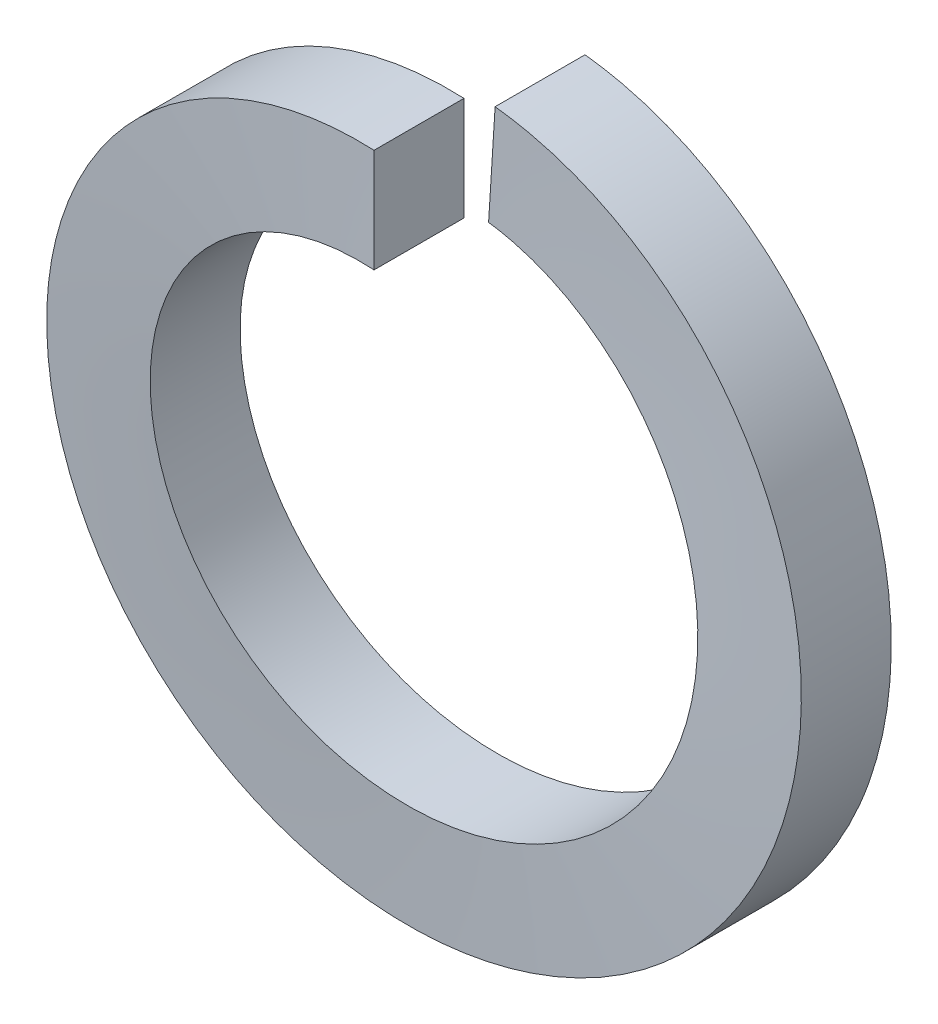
ISO-10303-21;
HEADER;
FILE_DESCRIPTION(('STEP AP214'),'2;1');
FILE_NAME('part.step','',(''),(''),'','','');
FILE_SCHEMA(('AUTOMOTIVE_DESIGN { 1 0 10303 214 1 1 1 1 }'));
ENDSEC;
DATA;
#1=APPLICATION_CONTEXT('core data for automotive mechanical design processes');
#2=APPLICATION_PROTOCOL_DEFINITION('international standard','automotive_design',2000,#1);
#3=PRODUCT_CONTEXT('',#1,'mechanical');
#4=PRODUCT('Part','Part','',(#3));
#5=PRODUCT_RELATED_PRODUCT_CATEGORY('part','',(#4));
#6=PRODUCT_DEFINITION_FORMATION('','',#4);
#7=PRODUCT_DEFINITION_CONTEXT('part definition',#1,'design');
#8=PRODUCT_DEFINITION('design','',#6,#7);
#9=PRODUCT_DEFINITION_SHAPE('','',#8);
#10=(LENGTH_UNIT() NAMED_UNIT(*) SI_UNIT(.MILLI.,.METRE.));
#11=(NAMED_UNIT(*) PLANE_ANGLE_UNIT() SI_UNIT($,.RADIAN.));
#12=(NAMED_UNIT(*) SI_UNIT($,.STERADIAN.) SOLID_ANGLE_UNIT());
#13=UNCERTAINTY_MEASURE_WITH_UNIT(LENGTH_MEASURE(1.E-05),#10,'distance_accuracy_value','');
#14=(GEOMETRIC_REPRESENTATION_CONTEXT(3) GLOBAL_UNCERTAINTY_ASSIGNED_CONTEXT((#13)) GLOBAL_UNIT_ASSIGNED_CONTEXT((#10,
#11,#12)) REPRESENTATION_CONTEXT('',''));
#15=CARTESIAN_POINT('',(0.,0.,0.));
#16=DIRECTION('',(0.,0.,1.));
#17=DIRECTION('',(1.,0.,0.));
#18=AXIS2_PLACEMENT_3D('',#15,#16,#17);
#19=CARTESIAN_POINT('',(0.,7.675,2.3));
#20=DIRECTION('',(1.,0.,0.));
#21=DIRECTION('',(0.,0.,-1.));
#22=AXIS2_PLACEMENT_3D('',#19,#20,#21);
#23=PLANE('',#22);
#24=CARTESIAN_POINT('',(0.,9.,2.3));
#25=CARTESIAN_POINT('',(0.,6.35,2.3));
#26=(BOUNDED_CURVE() B_SPLINE_CURVE(1,(#24,#25),.UNSPECIFIED.,.F.,
.F.) B_SPLINE_CURVE_WITH_KNOTS((2,2),(0.,1.),
.UNSPECIFIED.) CURVE() GEOMETRIC_REPRESENTATION_ITEM() RATIONAL_B_SPLINE_CURVE((1.,1.)) REPRESENTATION_ITEM(''));
#27=CARTESIAN_POINT('',(0.,9.,2.3));
#28=VERTEX_POINT('',#27);
#29=CARTESIAN_POINT('',(0.,6.35,2.3));
#30=VERTEX_POINT('',#29);
#31=EDGE_CURVE('E54',#28,#30,#26,.T.);
#32=ORIENTED_EDGE('',*,*,#31,.T.);
#33=CARTESIAN_POINT('',(0.,6.35,2.3));
#34=CARTESIAN_POINT('',(0.,6.35,0.));
#35=(BOUNDED_CURVE() B_SPLINE_CURVE(1,(#33,#34),.UNSPECIFIED.,.F.,
.F.) B_SPLINE_CURVE_WITH_KNOTS((2,2),(0.,1.),
.UNSPECIFIED.) CURVE() GEOMETRIC_REPRESENTATION_ITEM() RATIONAL_B_SPLINE_CURVE((1.,1.)) REPRESENTATION_ITEM(''));
#36=CARTESIAN_POINT('',(0.,6.35,0.));
#37=VERTEX_POINT('',#36);
#38=EDGE_CURVE('E86',#30,#37,#35,.T.);
#39=ORIENTED_EDGE('',*,*,#38,.T.);
#40=CARTESIAN_POINT('',(0.,6.35,0.));
#41=CARTESIAN_POINT('',(0.,9.,0.));
#42=(BOUNDED_CURVE() B_SPLINE_CURVE(1,(#40,#41),.UNSPECIFIED.,.F.,
.F.) B_SPLINE_CURVE_WITH_KNOTS((2,2),(0.,1.),
.UNSPECIFIED.) CURVE() GEOMETRIC_REPRESENTATION_ITEM() RATIONAL_B_SPLINE_CURVE((1.,1.)) REPRESENTATION_ITEM(''));
#43=CARTESIAN_POINT('',(0.,9.,0.));
#44=VERTEX_POINT('',#43);
#45=EDGE_CURVE('E89',#37,#44,#42,.T.);
#46=ORIENTED_EDGE('',*,*,#45,.T.);
#47=CARTESIAN_POINT('',(0.,9.,0.));
#48=CARTESIAN_POINT('',(0.,9.,2.3));
#49=(BOUNDED_CURVE() B_SPLINE_CURVE(1,(#47,#48),.UNSPECIFIED.,.F.,
.F.) B_SPLINE_CURVE_WITH_KNOTS((2,2),(0.,1.),
.UNSPECIFIED.) CURVE() GEOMETRIC_REPRESENTATION_ITEM() RATIONAL_B_SPLINE_CURVE((1.,1.)) REPRESENTATION_ITEM(''));
#50=EDGE_CURVE('E69',#44,#28,#49,.T.);
#51=ORIENTED_EDGE('',*,*,#50,.T.);
#52=EDGE_LOOP('',(#32,#39,#46,#51));
#53=FACE_BOUND('',#52,.T.);
#54=ADVANCED_FACE('F43',(#53),#23,.T.);
#55=CARTESIAN_POINT('',(0.440339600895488,6.99866110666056,-0.23060923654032));
#56=DIRECTION('',(0.998026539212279,-0.0627935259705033,1.11424147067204E-05));
#57=DIRECTION('',(0.0627935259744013,0.998026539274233,0.));
#58=AXIS2_PLACEMENT_3D('',#55,#56,#57);
#59=PLANE('',#58);
#60=CARTESIAN_POINT('',(0.565141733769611,8.9822388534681,-0.23060923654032));
#61=CARTESIAN_POINT('',(0.398738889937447,6.33746852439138,-0.23060923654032));
#62=(BOUNDED_CURVE() B_SPLINE_CURVE(1,(#60,#61),.UNSPECIFIED.,.F.,
.F.) B_SPLINE_CURVE_WITH_KNOTS((2,2),(0.,1.),
.UNSPECIFIED.) CURVE() GEOMETRIC_REPRESENTATION_ITEM() RATIONAL_B_SPLINE_CURVE((0.991096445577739,0.991096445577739)) REPRESENTATION_ITEM(''));
#63=CARTESIAN_POINT('',(0.398748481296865,6.33746792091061,-0.230608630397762));
#64=VERTEX_POINT('',#63);
#65=CARTESIAN_POINT('',(0.565141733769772,8.98223885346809,-0.230609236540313));
#66=VERTEX_POINT('',#65);
#67=EDGE_CURVE('E12',#64,#66,#62,.F.);
#68=ORIENTED_EDGE('',*,*,#67,.T.);
#69=CARTESIAN_POINT('',(0.565141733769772,8.98223885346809,-2.53060923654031));
#70=CARTESIAN_POINT('',(0.565141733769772,8.98223885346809,-0.230609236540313));
#71=(BOUNDED_CURVE() B_SPLINE_CURVE(1,(#69,#70),.UNSPECIFIED.,.F.,
.F.) B_SPLINE_CURVE_WITH_KNOTS((2,2),(0.,1.),
.UNSPECIFIED.) CURVE() GEOMETRIC_REPRESENTATION_ITEM() RATIONAL_B_SPLINE_CURVE((0.991096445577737,0.991096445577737)) REPRESENTATION_ITEM(''));
#72=CARTESIAN_POINT('',(0.565155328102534,8.98223799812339,-2.53060863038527));
#73=VERTEX_POINT('',#72);
#74=EDGE_CURVE('E131',#66,#73,#71,.F.);
#75=ORIENTED_EDGE('',*,*,#74,.T.);
#76=CARTESIAN_POINT('',(0.39875807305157,6.33746731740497,-2.53060802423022));
#77=CARTESIAN_POINT('',(0.565168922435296,8.9822371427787,-2.53060802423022));
#78=(BOUNDED_CURVE() B_SPLINE_CURVE(1,(#76,#77),.UNSPECIFIED.,.F.,
.F.) B_SPLINE_CURVE_WITH_KNOTS((2,2),(0.,1.),
.UNSPECIFIED.) CURVE() GEOMETRIC_REPRESENTATION_ITEM() RATIONAL_B_SPLINE_CURVE((0.991096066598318,0.991096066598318)) REPRESENTATION_ITEM(''));
#79=CARTESIAN_POINT('',(0.398758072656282,6.33746731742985,-2.5306080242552));
#80=VERTEX_POINT('',#79);
#81=EDGE_CURVE('E109',#73,#80,#78,.F.);
#82=ORIENTED_EDGE('',*,*,#81,.T.);
#83=CARTESIAN_POINT('',(0.398758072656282,6.33746731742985,-0.230608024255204));
#84=CARTESIAN_POINT('',(0.398758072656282,6.33746731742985,-2.5306080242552));
#85=(BOUNDED_CURVE() B_SPLINE_CURVE(1,(#83,#84),.UNSPECIFIED.,.F.,
.F.) B_SPLINE_CURVE_WITH_KNOTS((2,2),(0.,1.),
.UNSPECIFIED.) CURVE() GEOMETRIC_REPRESENTATION_ITEM() RATIONAL_B_SPLINE_CURVE((0.991096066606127,0.991096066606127)) REPRESENTATION_ITEM(''));
#86=EDGE_CURVE('E94',#80,#64,#85,.F.);
#87=ORIENTED_EDGE('',*,*,#86,.T.);
#88=EDGE_LOOP('',(#68,#75,#82,#87));
#89=FACE_BOUND('',#88,.T.);
#90=ADVANCED_FACE('F45',(#89),#59,.F.);
#91=CARTESIAN_POINT('',(0.,9.,2.3));
#92=CARTESIAN_POINT('',(-2.92427726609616,9.,2.17222222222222));
#93=CARTESIAN_POINT('',(-5.29006727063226,7.28115294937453,2.04444444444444));
#94=CARTESIAN_POINT('',(-7.65585727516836,5.56230589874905,1.91666666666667));
#95=CARTESIAN_POINT('',(-8.55950864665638,2.78115294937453,1.78888888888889));
#96=CARTESIAN_POINT('',(-9.4631600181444,0.,1.66111111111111));
#97=CARTESIAN_POINT('',(-8.55950864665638,-2.78115294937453,1.53333333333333));
#98=CARTESIAN_POINT('',(-7.65585727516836,-5.56230589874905,1.40555555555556));
#99=CARTESIAN_POINT('',(-5.29006727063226,-7.28115294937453,1.27777777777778));
#100=CARTESIAN_POINT('',(-2.92427726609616,-9.,1.15));
#101=CARTESIAN_POINT('',(0.,-9.,1.02222222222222));
#102=CARTESIAN_POINT('',(2.92427726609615,-9.,0.894444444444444));
#103=CARTESIAN_POINT('',(5.29006727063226,-7.28115294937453,0.766666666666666));
#104=CARTESIAN_POINT('',(7.65585727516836,-5.56230589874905,0.638888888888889));
#105=CARTESIAN_POINT('',(8.55950864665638,-2.78115294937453,0.511111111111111));
#106=CARTESIAN_POINT('',(9.4631600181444,0.,0.383333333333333));
#107=CARTESIAN_POINT('',(8.55950864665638,2.78115294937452,0.255555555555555));
#108=CARTESIAN_POINT('',(7.65585727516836,5.56230589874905,0.127777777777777));
#109=CARTESIAN_POINT('',(5.29006727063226,7.28115294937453,0.));
#110=CARTESIAN_POINT('',(3.17470868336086,8.81805092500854,-0.114251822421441));
#111=CARTESIAN_POINT('',(0.565141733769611,8.9822388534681,-0.23060923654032));
#112=CARTESIAN_POINT('',(0.,6.35,2.3));
#113=CARTESIAN_POINT('',(-2.06324007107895,6.35,2.17222222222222));
#114=CARTESIAN_POINT('',(-3.7324363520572,5.13725791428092,2.04444444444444));
#115=CARTESIAN_POINT('',(-5.40163263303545,3.92451582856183,1.91666666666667));
#116=CARTESIAN_POINT('',(-6.03920887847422,1.96225791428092,1.78888888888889));
#117=CARTESIAN_POINT('',(-6.676785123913,0.,1.66111111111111));
#118=CARTESIAN_POINT('',(-6.03920887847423,-1.96225791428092,1.53333333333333));
#119=CARTESIAN_POINT('',(-5.40163263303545,-3.92451582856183,1.40555555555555));
#120=CARTESIAN_POINT('',(-3.73243635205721,-5.13725791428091,1.27777777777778));
#121=CARTESIAN_POINT('',(-2.06324007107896,-6.35,1.15));
#122=CARTESIAN_POINT('',(0.,-6.35,1.02222222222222));
#123=CARTESIAN_POINT('',(2.06324007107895,-6.35,0.894444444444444));
#124=CARTESIAN_POINT('',(3.7324363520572,-5.13725791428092,0.766666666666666));
#125=CARTESIAN_POINT('',(5.40163263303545,-3.92451582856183,0.638888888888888));
#126=CARTESIAN_POINT('',(6.03920887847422,-1.96225791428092,0.51111111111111));
#127=CARTESIAN_POINT('',(6.676785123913,0.,0.383333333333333));
#128=CARTESIAN_POINT('',(6.03920887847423,1.96225791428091,0.255555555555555));
#129=CARTESIAN_POINT('',(5.40163263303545,3.92451582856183,0.127777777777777));
#130=CARTESIAN_POINT('',(3.73243635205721,5.13725791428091,0.));
#131=CARTESIAN_POINT('',(2.23993334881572,6.22162481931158,-0.114251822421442));
#132=CARTESIAN_POINT('',(0.398738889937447,6.33746852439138,-0.23060923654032));
#133=(BOUNDED_SURFACE() B_SPLINE_SURFACE(1,2,((#91,#92,#93,#94,#95,#96,#97,#98,#99,#100,#101,
#102,#103,#104,#105,#106,#107,#108,#109,#110,#111),(#112,#113,#114,#115,#116,#117,#118,#119,
#120,#121,#122,#123,#124,#125,#126,#127,#128,#129,#130,#131,#132)),.UNSPECIFIED.,.F.,.F.,
.F.) B_SPLINE_SURFACE_WITH_KNOTS((2,2),(3,2,2,2,2,2,2,2,2,2,3),(0.,1.),(0.,0.1,0.2,0.3,0.4,0.5,
0.6,0.7,0.8,0.9,0.989880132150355),
.UNSPECIFIED.) GEOMETRIC_REPRESENTATION_ITEM() RATIONAL_B_SPLINE_SURFACE(((1.,0.951056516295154,
1.,0.951056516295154,1.,0.951056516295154,1.,0.951056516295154,1.,0.951056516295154,1.,
0.951056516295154,1.,0.951056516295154,1.,0.951056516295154,1.,0.951056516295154,1.,
0.956009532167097,0.991096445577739),(1.,0.951056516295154,1.,0.951056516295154,1.,
0.951056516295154,1.,0.951056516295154,1.,0.951056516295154,1.,0.951056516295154,1.,
0.951056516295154,1.,0.951056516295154,1.,0.951056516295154,1.,0.956009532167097,0.991096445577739))) REPRESENTATION_ITEM('') SURFACE());
#134=CARTESIAN_POINT('',(0.,9.,2.3));
#135=CARTESIAN_POINT('',(-2.92427726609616,9.,2.17222222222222));
#136=CARTESIAN_POINT('',(-5.29006727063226,7.28115294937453,2.04444444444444));
#137=CARTESIAN_POINT('',(-7.65585727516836,5.56230589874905,1.91666666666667));
#138=CARTESIAN_POINT('',(-8.55950864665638,2.78115294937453,1.78888888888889));
#139=CARTESIAN_POINT('',(-9.4631600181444,0.,1.66111111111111));
#140=CARTESIAN_POINT('',(-8.55950864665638,-2.78115294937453,1.53333333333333));
#141=CARTESIAN_POINT('',(-7.65585727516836,-5.56230589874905,1.40555555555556));
#142=CARTESIAN_POINT('',(-5.29006727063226,-7.28115294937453,1.27777777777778));
#143=CARTESIAN_POINT('',(-2.92427726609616,-9.,1.15));
#144=CARTESIAN_POINT('',(0.,-9.,1.02222222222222));
#145=CARTESIAN_POINT('',(2.92427726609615,-9.,0.894444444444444));
#146=CARTESIAN_POINT('',(5.29006727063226,-7.28115294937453,0.766666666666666));
#147=CARTESIAN_POINT('',(7.65585727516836,-5.56230589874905,0.638888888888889));
#148=CARTESIAN_POINT('',(8.55950864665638,-2.78115294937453,0.511111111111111));
#149=CARTESIAN_POINT('',(9.4631600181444,0.,0.383333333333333));
#150=CARTESIAN_POINT('',(8.55950864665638,2.78115294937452,0.255555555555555));
#151=CARTESIAN_POINT('',(7.65585727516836,5.56230589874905,0.127777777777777));
#152=CARTESIAN_POINT('',(5.29006727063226,7.28115294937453,0.));
#153=CARTESIAN_POINT('',(3.17470868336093,8.81805092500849,-0.114251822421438));
#154=CARTESIAN_POINT('',(0.565141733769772,8.98223885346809,-0.230609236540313));
#155=(BOUNDED_CURVE() B_SPLINE_CURVE(2,(#134,#135,#136,#137,#138,#139,#140,#141,#142,#143,#144,
#145,#146,#147,#148,#149,#150,#151,#152,#153,#154),.UNSPECIFIED.,.F.,
.F.) B_SPLINE_CURVE_WITH_KNOTS((3,2,2,2,2,2,2,2,2,2,3),(0.,0.1,0.2,0.3,0.4,0.5,0.6,0.7,0.8,0.9,
0.989880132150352),
.UNSPECIFIED.) CURVE() GEOMETRIC_REPRESENTATION_ITEM() RATIONAL_B_SPLINE_CURVE((1.,
0.951056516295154,1.,0.951056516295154,1.,0.951056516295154,1.,0.951056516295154,1.,
0.951056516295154,1.,0.951056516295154,1.,0.951056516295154,1.,0.951056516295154,1.,
0.951056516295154,1.,0.956009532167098,0.991096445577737)) REPRESENTATION_ITEM(''));
#156=EDGE_CURVE('E61',#28,#66,#155,.T.);
#157=CARTESIAN_POINT('',(0.,6.35,2.3));
#158=CARTESIAN_POINT('',(-0.0737729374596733,6.3500005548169,2.29543120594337));
#159=CARTESIAN_POINT('',(-0.147544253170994,6.34871440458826,2.2908366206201));
#160=CARTESIAN_POINT('',(-0.295360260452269,6.3435602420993,2.2815785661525));
#161=CARTESIAN_POINT('',(-0.369404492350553,6.33967945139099,2.27691486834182));
#162=CARTESIAN_POINT('',(-0.517630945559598,6.3293050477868,2.26752635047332));
#163=CARTESIAN_POINT('',(-0.591812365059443,6.32280013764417,2.26280135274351));
#164=CARTESIAN_POINT('',(-0.740174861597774,6.30715671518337,2.25329838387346));
#165=CARTESIAN_POINT('',(-0.814354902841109,6.29800845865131,2.24852028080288));
#166=CARTESIAN_POINT('',(-0.962574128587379,6.27706701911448,2.23891957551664));
#167=CARTESIAN_POINT('',(-1.03661215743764,6.26526569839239,2.23409688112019));
#168=CARTESIAN_POINT('',(-1.18440552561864,6.23901678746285,2.22441574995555));
#169=CARTESIAN_POINT('',(-1.25815970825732,6.22456270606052,2.21955725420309));
#170=CARTESIAN_POINT('',(-1.40524310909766,6.19301698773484,2.20981350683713));
#171=CARTESIAN_POINT('',(-1.47857129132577,6.17592053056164,2.20492822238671));
#172=CARTESIAN_POINT('',(-1.62466087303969,6.13910891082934,2.19514005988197));
#173=CARTESIAN_POINT('',(-1.69742148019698,6.1193906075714,2.19023716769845));
#174=CARTESIAN_POINT('',(-1.84223545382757,6.07736423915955,2.18042307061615));
#175=CARTESIAN_POINT('',(-1.91428839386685,6.05505470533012,2.17551186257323));
#176=CARTESIAN_POINT('',(-2.05754883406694,6.00788478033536,2.16569047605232));
#177=CARTESIAN_POINT('',(-2.12875639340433,5.98302456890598,2.16078029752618));
#178=CARTESIAN_POINT('',(-2.2701910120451,5.93080192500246,2.15097031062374));
#179=CARTESIAN_POINT('',(-2.34041873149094,5.90344128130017,2.14607049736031));
#180=CARTESIAN_POINT('',(-2.47976260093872,5.84627581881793,2.13629053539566));
#181=CARTESIAN_POINT('',(-2.54888012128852,5.8164743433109,2.13141036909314));
#182=CARTESIAN_POINT('',(-2.68587732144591,5.75449426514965,2.12167883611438));
#183=CARTESIAN_POINT('',(-2.75375918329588,5.72232049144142,2.11682743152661));
#184=CARTESIAN_POINT('',(-2.88816436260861,5.65567136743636,2.10716254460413));
#185=CARTESIAN_POINT('',(-2.95469076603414,5.62120224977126,2.10234899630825));
#186=CARTESIAN_POINT('',(-3.08627055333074,5.5500459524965,2.09276811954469));
#187=CARTESIAN_POINT('',(-3.15132800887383,5.51336631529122,2.08800069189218));
#188=CARTESIAN_POINT('',(-3.2798624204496,5.43787972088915,2.07852229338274));
#189=CARTESIAN_POINT('',(-3.34334450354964,5.39908151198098,2.07381117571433));
#190=CARTESIAN_POINT('',(-3.46862772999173,5.31945544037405,2.06444707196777));
#191=CARTESIAN_POINT('',(-3.53043511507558,5.27863741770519,2.05979392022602));
#192=CARTESIAN_POINT('',(-3.65229420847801,5.19506295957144,2.05057635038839));
#193=CARTESIAN_POINT('',(-3.71235292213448,5.15231677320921,2.04601161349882));
#194=CARTESIAN_POINT('',(-3.83106536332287,5.06467107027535,2.03684026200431));
#195=CARTESIAN_POINT('',(-3.88971596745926,5.01976733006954,2.0322335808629));
#196=CARTESIAN_POINT('',(-4.00569197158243,4.92772147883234,2.02294825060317));
#197=CARTESIAN_POINT('',(-4.06300960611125,4.88056960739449,2.01826936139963));
#198=CARTESIAN_POINT('',(-4.17619324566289,4.78408436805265,2.0088535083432));
#199=CARTESIAN_POINT('',(-4.23205211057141,4.73474263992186,2.00411638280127));
#200=CARTESIAN_POINT('',(-4.34219468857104,4.63394413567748,1.99459064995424));
#201=CARTESIAN_POINT('',(-4.39647201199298,4.5824803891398,1.98980191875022));
#202=CARTESIAN_POINT('',(-4.50333220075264,4.47751326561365,1.98018195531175));
#203=CARTESIAN_POINT('',(-4.55590955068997,4.42400428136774,1.97535063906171));
#204=CARTESIAN_POINT('',(-4.65925540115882,4.31503084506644,1.9656541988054));
#205=CARTESIAN_POINT('',(-4.7100193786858,4.25956210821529,1.96078902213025));
#206=CARTESIAN_POINT('',(-4.80962983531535,4.14676163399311,1.95103392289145));
#207=CARTESIAN_POINT('',(-4.85847289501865,4.08942687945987,1.94614397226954));
#208=CARTESIAN_POINT('',(-4.95413935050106,3.9729946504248,1.93634850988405));
#209=CARTESIAN_POINT('',(-5.00096053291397,3.91389535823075,1.9314429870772));
#210=CARTESIAN_POINT('',(-5.09248825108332,3.79404156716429,1.92162568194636));
#211=CARTESIAN_POINT('',(-5.13719387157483,3.73328636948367,1.91671389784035));
#212=CARTESIAN_POINT('',(-5.2244032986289,3.6102348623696,1.9068934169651));
#213=CARTESIAN_POINT('',(-5.26690756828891,3.54793888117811,1.90198471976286));
#214=CARTESIAN_POINT('',(-5.34963550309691,3.42192576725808,1.89217974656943));
#215=CARTESIAN_POINT('',(-5.38986107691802,3.35820988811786,1.88728346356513));
#216=CARTESIAN_POINT('',(-5.46796168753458,3.22948203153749,1.87751258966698));
#217=CARTESIAN_POINT('',(-5.50584013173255,3.16447212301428,1.87263797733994));
#218=CARTESIAN_POINT('',(-5.57918580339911,3.03328553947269,1.86291955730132));
#219=CARTESIAN_POINT('',(-5.61465797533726,2.9671116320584,1.85807570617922));
#220=CARTESIAN_POINT('',(-5.68313998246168,2.83372980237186,1.84842784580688));
#221=CARTESIAN_POINT('',(-5.71615632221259,2.76652522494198,1.84362376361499));
#222=CARTESIAN_POINT('',(-5.77968530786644,2.63121738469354,1.83406382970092));
#223=CARTESIAN_POINT('',(-5.81020602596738,2.56311791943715,1.82930786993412));
#224=CARTESIAN_POINT('',(-5.86871232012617,2.42615721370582,1.8198537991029));
#225=CARTESIAN_POINT('',(-5.89670752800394,2.35730009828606,1.81515553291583));
#226=CARTESIAN_POINT('',(-5.95014117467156,2.21896212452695,1.80582048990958));
#227=CARTESIAN_POINT('',(-5.97559078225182,2.14948559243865,1.80118352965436));
#228=CARTESIAN_POINT('',(-6.02394765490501,2.00997078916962,1.79199034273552));
#229=CARTESIAN_POINT('',(-6.04686498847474,1.93993602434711,1.78743386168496));
#230=CARTESIAN_POINT('',(-6.09032462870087,1.79886435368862,1.77825055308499));
#231=CARTESIAN_POINT('',(-6.11085820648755,1.72782477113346,1.77362353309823));
#232=CARTESIAN_POINT('',(-6.14952184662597,1.58473935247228,1.76430533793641));
#233=CARTESIAN_POINT('',(-6.16764017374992,1.5126903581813,1.75961396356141));
#234=CARTESIAN_POINT('',(-6.20140604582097,1.36770817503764,1.75017326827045));
#235=CARTESIAN_POINT('',(-6.21704320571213,1.29477257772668,1.74542378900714));
#236=CARTESIAN_POINT('',(-6.24578776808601,1.14814456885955,1.73587564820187));
#237=CARTESIAN_POINT('',(-6.25888622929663,1.07445041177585,1.73107687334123));
#238=CARTESIAN_POINT('',(-6.28250316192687,0.926437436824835,1.72143862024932));
#239=CARTESIAN_POINT('',(-6.29301421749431,0.852117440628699,1.71659906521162));
#240=CARTESIAN_POINT('',(-6.31141533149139,0.702988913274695,1.7068881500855));
#241=CARTESIAN_POINT('',(-6.3192995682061,0.628179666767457,1.70201674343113));
#242=CARTESIAN_POINT('',(-6.33241563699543,0.478211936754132,1.69225118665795));
#243=CARTESIAN_POINT('',(-6.33764329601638,0.403053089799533,1.68735701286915));
#244=CARTESIAN_POINT('',(-6.34542469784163,0.252527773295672,1.67755514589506));
#245=CARTESIAN_POINT('',(-6.34797595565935,0.17716117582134,1.67264744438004));
#246=CARTESIAN_POINT('',(-6.35039314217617,0.0263634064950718,1.66282783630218));
#247=CARTESIAN_POINT('',(-6.35025829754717,-0.0490677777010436,1.65791592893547));
#248=CARTESIAN_POINT('',(-6.34730207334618,-0.199851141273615,1.64809725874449));
#249=CARTESIAN_POINT('',(-6.34448163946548,-0.275203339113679,1.64319049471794));
#250=CARTESIAN_POINT('',(-6.3361632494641,-0.425685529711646,1.63339143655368));
#251=CARTESIAN_POINT('',(-6.33066794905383,-0.500815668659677,1.62849913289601));
#252=CARTESIAN_POINT('',(-6.31701897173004,-0.650711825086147,1.61873823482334));
#253=CARTESIAN_POINT('',(-6.30886963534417,-0.72547823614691,1.61386961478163));
#254=CARTESIAN_POINT('',(-6.28994168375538,-0.87450719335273,1.60416519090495));
#255=CARTESIAN_POINT('',(-6.27916905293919,-0.948770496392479,1.59932933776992));
#256=CARTESIAN_POINT('',(-6.25503328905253,-1.09665652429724,1.58969932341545));
#257=CARTESIAN_POINT('',(-6.24167772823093,-1.17028047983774,1.58490508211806));
#258=CARTESIAN_POINT('',(-6.21242419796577,-1.31675496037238,1.57536704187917));
#259=CARTESIAN_POINT('',(-6.19653531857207,-1.38960729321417,1.57062312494));
#260=CARTESIAN_POINT('',(-6.16227212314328,-1.53441027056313,1.5611937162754));
#261=CARTESIAN_POINT('',(-6.14390833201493,-1.60636339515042,1.55650806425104));
#262=CARTESIAN_POINT('',(-6.10476063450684,-1.74924514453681,1.54720455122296));
#263=CARTESIAN_POINT('',(-6.08398859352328,-1.82017700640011,1.54258647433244));
#264=CARTESIAN_POINT('',(-6.0400445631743,-1.96106882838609,1.53340961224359));
#265=CARTESIAN_POINT('',(-6.01687976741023,-2.03103102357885,1.52885069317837));
#266=CARTESIAN_POINT('',(-5.96802029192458,-2.17041761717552,1.51964738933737));
#267=CARTESIAN_POINT('',(-5.94231464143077,-2.239838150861,1.51500271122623));
#268=CARTESIAN_POINT('',(-5.88837029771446,-2.3780503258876,1.50565410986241));
#269=CARTESIAN_POINT('',(-5.86012058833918,-2.44683765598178,1.50095001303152));
#270=CARTESIAN_POINT('',(-5.80110769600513,-2.58364492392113,1.49148480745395));
#271=CARTESIAN_POINT('',(-5.77033503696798,-2.65166076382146,1.48672354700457));
#272=CARTESIAN_POINT('',(-5.70630555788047,-2.78678761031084,1.47715394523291));
#273=CARTESIAN_POINT('',(-5.67304082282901,-2.85389485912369,1.47234550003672));
#274=CARTESIAN_POINT('',(-5.60406640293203,-2.98706847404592,1.46268977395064));
#275=CARTESIAN_POINT('',(-5.56835037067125,-3.05313154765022,1.45784242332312));
#276=CARTESIAN_POINT('',(-5.49452232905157,-3.18408318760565,1.44811791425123));
#277=CARTESIAN_POINT('',(-5.45640553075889,-3.24896905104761,1.44324071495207));
#278=CARTESIAN_POINT('',(-5.37783451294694,-3.37743590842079,1.43346558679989));
#279=CARTESIAN_POINT('',(-5.33737703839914,-3.44101491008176,1.4285676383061));
#280=CARTESIAN_POINT('',(-5.25419252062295,-3.56674181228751,1.41876026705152));
#281=CARTESIAN_POINT('',(-5.21146371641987,-3.62888854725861,1.41385083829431));
#282=CARTESIAN_POINT('',(-5.12381331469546,-3.75162963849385,1.40402983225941));
#283=CARTESIAN_POINT('',(-5.07889139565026,-3.81222376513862,1.39911825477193));
#284=CARTESIAN_POINT('',(-4.98694000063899,-3.93174410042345,1.38930229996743));
#285=CARTESIAN_POINT('',(-4.93991157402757,-3.99067111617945,1.38439792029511));
#286=CARTESIAN_POINT('',(-4.84384031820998,-4.10674815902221,1.37460567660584));
#287=CARTESIAN_POINT('',(-4.79479982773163,-4.16390012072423,1.36971780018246));
#288=CARTESIAN_POINT('',(-4.69480490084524,-4.27632511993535,1.35996776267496));
#289=CARTESIAN_POINT('',(-4.64385399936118,-4.33160129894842,1.35510557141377));
#290=CARTESIAN_POINT('',(-4.54014532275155,-4.4401805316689,1.34541602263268));
#291=CARTESIAN_POINT('',(-4.4873921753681,-4.49348800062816,1.34058860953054));
#292=CARTESIAN_POINT('',(-4.38019197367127,-4.59804385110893,1.33097725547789));
#293=CARTESIAN_POINT('',(-4.3257505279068,-4.64929797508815,1.32619322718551));
#294=CARTESIAN_POINT('',(-4.21529174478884,-4.74966989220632,1.31667802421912));
#295=CARTESIAN_POINT('',(-4.15928087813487,-4.79879479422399,1.31194672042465));
#296=CARTESIAN_POINT('',(-4.04580573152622,-4.894839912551,1.30254230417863));
#297=CARTESIAN_POINT('',(-3.98834865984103,-4.94176862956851,1.29786902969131));
#298=CARTESIAN_POINT('',(-3.87210634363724,-5.03336281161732,1.28859949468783));
#299=CARTESIAN_POINT('',(-3.81332892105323,-5.07803817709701,1.28400297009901));
#300=CARTESIAN_POINT('',(-3.69432117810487,-5.16526158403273,1.27483441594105));
#301=CARTESIAN_POINT('',(-3.63409264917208,-5.20781206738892,1.27026236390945));
#302=CARTESIAN_POINT('',(-3.51189161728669,-5.29099305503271,1.26103099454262));
#303=CARTESIAN_POINT('',(-3.44991195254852,-5.3316130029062,1.2563713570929));
#304=CARTESIAN_POINT('',(-3.32429364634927,-5.41083265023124,1.24699482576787));
#305=CARTESIAN_POINT('',(-3.26064887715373,-5.44942261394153,1.24227776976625));
#306=CARTESIAN_POINT('',(-3.13179933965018,-5.52448306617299,1.23278839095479));
#307=CARTESIAN_POINT('',(-3.06658955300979,-5.56094492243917,1.22801592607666));
#308=CARTESIAN_POINT('',(-2.93471608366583,-5.63165668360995,1.21842581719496));
#309=CARTESIAN_POINT('',(-2.86804843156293,-5.665899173,1.21360807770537));
#310=CARTESIAN_POINT('',(-2.73337240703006,-5.73208681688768,1.20393570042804));
#311=CARTESIAN_POINT('',(-2.66536104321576,-5.76402587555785,1.19908099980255));
#312=CARTESIAN_POINT('',(-2.52811709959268,-5.8255291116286,1.18934378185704));
#313=CARTESIAN_POINT('',(-2.45888242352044,-5.85508860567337,1.18446122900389));
#314=CARTESIAN_POINT('',(-2.31931703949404,-5.91176356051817,1.17467741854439));
#315=CARTESIAN_POINT('',(-2.2489850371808,-5.9388758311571,1.16977614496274));
#316=CARTESIAN_POINT('',(-2.10735510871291,-5.99059609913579,1.15996417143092));
#317=CARTESIAN_POINT('',(-2.03605658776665,-6.01520246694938,1.15505346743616));
#318=CARTESIAN_POINT('',(-1.89262785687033,-6.06186002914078,1.14523196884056));
#319=CARTESIAN_POINT('',(-1.82049764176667,-6.08391120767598,1.14032117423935));
#320=CARTESIAN_POINT('',(-1.67554304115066,-6.12541717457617,1.13050883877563));
#321=CARTESIAN_POINT('',(-1.60271912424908,-6.14487359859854,1.12560729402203));
#322=CARTESIAN_POINT('',(-1.45651704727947,-6.18115877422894,1.11582276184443));
#323=CARTESIAN_POINT('',(-1.38313970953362,-6.19799083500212,1.11093975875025));
#324=CARTESIAN_POINT('',(-1.23597223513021,-6.22900609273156,1.10120146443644));
#325=CARTESIAN_POINT('',(-1.16218315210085,-6.24319427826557,1.09634613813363));
#326=CARTESIAN_POINT('',(-1.01433423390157,-6.2689107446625,1.08667233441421));
#327=CARTESIAN_POINT('',(-0.940275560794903,-6.28044568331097,1.08185379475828));
#328=CARTESIAN_POINT('',(-0.792029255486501,-6.30085472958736,1.07226192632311));
#329=CARTESIAN_POINT('',(-0.717842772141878,-6.30973713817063,1.06748850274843));
#330=CARTESIAN_POINT('',(-0.569481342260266,-6.32485018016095,1.05799701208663));
#331=CARTESIAN_POINT('',(-0.495307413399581,-6.33109071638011,1.05327880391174));
#332=CARTESIAN_POINT('',(-0.347110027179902,-6.34093883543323,1.04389993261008));
#333=CARTESIAN_POINT('',(-0.273087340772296,-6.34455786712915,1.03923910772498));
#334=CARTESIAN_POINT('',(-0.125322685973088,-6.34919136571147,1.03000488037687));
#335=CARTESIAN_POINT('',(-0.0515811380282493,-6.35021861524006,1.02543115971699));
#336=CARTESIAN_POINT('',(0.0959656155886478,-6.3497038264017,1.01626295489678));
#337=CARTESIAN_POINT('',(0.169770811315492,-6.34815922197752,1.01166845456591));
#338=CARTESIAN_POINT('',(0.317640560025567,-6.34248419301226,1.00240202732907));
#339=CARTESIAN_POINT('',(0.391704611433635,-6.33834113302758,0.997729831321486));
#340=CARTESIAN_POINT('',(0.539957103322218,-6.32743979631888,0.988327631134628));
#341=CARTESIAN_POINT('',(0.61414471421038,-6.32067037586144,0.983597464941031));
#342=CARTESIAN_POINT('',(0.762505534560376,-6.30449632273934,0.974084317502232));
#343=CARTESIAN_POINT('',(0.836677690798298,-6.29508210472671,0.969301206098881));
#344=CARTESIAN_POINT('',(0.984866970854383,-6.27360816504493,0.95969153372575));
#345=CARTESIAN_POINT('',(1.0588829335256,-6.26154046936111,0.954864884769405));
#346=CARTESIAN_POINT('',(1.20661789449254,-6.23475922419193,0.945176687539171));
#347=CARTESIAN_POINT('',(1.28033574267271,-6.22003935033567,0.940315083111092));
#348=CARTESIAN_POINT('',(1.42733220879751,-6.1879634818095,0.930566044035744));
#349=CARTESIAN_POINT('',(1.50060980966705,-6.17060283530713,0.925678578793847));
#350=CARTESIAN_POINT('',(1.64658405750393,-6.13326528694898,0.915886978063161));
#351=CARTESIAN_POINT('',(1.71927994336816,-6.11328541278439,0.910982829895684));
#352=CARTESIAN_POINT('',(1.86395048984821,-6.07073936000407,0.90116715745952));
#353=CARTESIAN_POINT('',(1.93592476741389,-6.04817187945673,0.896255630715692));
#354=CARTESIAN_POINT('',(2.07901417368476,-6.00049050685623,0.886434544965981));
#355=CARTESIAN_POINT('',(2.15012941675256,-5.9753769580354,0.881524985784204));
#356=CARTESIAN_POINT('',(2.29136605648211,-5.92265304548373,0.871717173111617));
#357=CARTESIAN_POINT('',(2.36148817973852,-5.89504462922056,0.866818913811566));
#358=CARTESIAN_POINT('',(2.50060795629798,-5.83738995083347,0.857042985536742));
#359=CARTESIAN_POINT('',(2.56960705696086,-5.80734718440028,0.852165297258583));
#360=CARTESIAN_POINT('',(2.70635504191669,-5.74489173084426,0.842439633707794));
#361=CARTESIAN_POINT('',(2.77410619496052,-5.71248401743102,0.837591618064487));
#362=CARTESIAN_POINT('',(2.90823817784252,-5.64537504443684,0.827934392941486));
#363=CARTESIAN_POINT('',(2.97462218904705,-5.61068015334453,0.823125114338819));
#364=CARTESIAN_POINT('',(3.10590607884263,-5.53908110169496,0.813553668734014));
#365=CARTESIAN_POINT('',(3.17081013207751,-5.50218460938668,0.808791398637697));
#366=CARTESIAN_POINT('',(3.29902734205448,-5.42627379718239,0.799324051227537));
#367=CARTESIAN_POINT('',(3.36234573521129,-5.38726834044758,0.794618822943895));
#368=CARTESIAN_POINT('',(3.48729198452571,-5.30723787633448,0.785267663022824));
#369=CARTESIAN_POINT('',(3.54892619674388,-5.26622281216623,0.780621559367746));
#370=CARTESIAN_POINT('',(3.67044824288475,-5.18225233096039,0.771416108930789));
#371=CARTESIAN_POINT('',(3.73034276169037,-5.13930662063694,0.766856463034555));
#372=CARTESIAN_POINT('',(3.848764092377,-5.05123504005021,0.757680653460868));
#373=CARTESIAN_POINT('',(3.90728660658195,-5.00610340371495,0.753064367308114));
#374=CARTESIAN_POINT('',(4.02299374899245,-4.9136069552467,0.743763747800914));
#375=CARTESIAN_POINT('',(4.08017066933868,-4.86623252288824,0.739079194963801));
#376=CARTESIAN_POINT('',(4.193060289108,-4.76930843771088,0.72965197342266));
#377=CARTESIAN_POINT('',(4.24876591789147,-4.71975056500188,0.724909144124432));
#378=CARTESIAN_POINT('',(4.35858986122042,-4.61852692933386,0.715373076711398));
#379=CARTESIAN_POINT('',(4.41270186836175,-4.56685433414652,0.71057971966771));
#380=CARTESIAN_POINT('',(4.51921970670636,-4.46147757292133,0.70095131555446));
#381=CARTESIAN_POINT('',(4.57162011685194,-4.40776793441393,0.696116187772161));
#382=CARTESIAN_POINT('',(4.67460091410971,-4.29840210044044,0.686413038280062));
#383=CARTESIAN_POINT('',(4.7251768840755,-4.24274175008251,0.681544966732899));
#384=CARTESIAN_POINT('',(4.82440076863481,-4.12956776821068,0.671784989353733));
#385=CARTESIAN_POINT('',(4.87304538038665,-4.07205124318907,0.666893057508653));
#386=CARTESIAN_POINT('',(4.96830507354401,-3.95526594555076,0.657094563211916));
#387=CARTESIAN_POINT('',(5.01491806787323,-3.89599547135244,0.652187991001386));
#388=CARTESIAN_POINT('',(5.10602030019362,-3.77581047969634,0.642369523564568));
#389=CARTESIAN_POINT('',(5.15050875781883,-3.71489537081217,0.637457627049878));
#390=CARTESIAN_POINT('',(5.23727556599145,-3.59153582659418,0.627637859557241));
#391=CARTESIAN_POINT('',(5.27955452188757,-3.5290918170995,0.622729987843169));
#392=CARTESIAN_POINT('',(5.36182440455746,-3.40279497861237,0.612927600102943));
#393=CARTESIAN_POINT('',(5.40181738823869,-3.33894349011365,0.608033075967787));
#394=CARTESIAN_POINT('',(5.47944630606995,-3.20995721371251,0.598266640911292));
#395=CARTESIAN_POINT('',(5.51708580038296,-3.14482457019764,0.593394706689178));
#396=CARTESIAN_POINT('',(5.58994800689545,-3.0134056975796,0.583682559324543));
#397=CARTESIAN_POINT('',(5.6251758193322,-2.94712229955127,0.578842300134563));
#398=CARTESIAN_POINT('',(5.69316451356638,-2.81353496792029,0.569202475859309));
#399=CARTESIAN_POINT('',(5.72593205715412,-2.74623443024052,0.564402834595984));
#400=CARTESIAN_POINT('',(5.78895984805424,-2.61074834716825,0.55485276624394));
#401=CARTESIAN_POINT('',(5.81922832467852,-2.54256663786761,0.550102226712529));
#402=CARTESIAN_POINT('',(5.87722751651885,-2.4054552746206,0.540659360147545));
#403=CARTESIAN_POINT('',(5.90496801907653,-2.33652977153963,0.535966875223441));
#404=CARTESIAN_POINT('',(5.95789067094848,-2.1980687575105,0.526645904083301));
#405=CARTESIAN_POINT('',(5.98308414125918,-2.12853758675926,0.522017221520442));
#406=CARTESIAN_POINT('',(6.03094073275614,-1.98888957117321,0.512832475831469));
#407=CARTESIAN_POINT('',(6.05361274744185,-1.91877578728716,0.508276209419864));
#408=CARTESIAN_POINT('',(6.09658913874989,-1.77751887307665,0.499084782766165));
#409=CARTESIAN_POINT('',(6.11688352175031,-1.70637271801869,0.494449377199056));
#410=CARTESIAN_POINT('',(6.15506170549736,-1.56308602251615,0.485117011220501));
#411=CARTESIAN_POINT('',(6.17293390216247,-1.49094240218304,0.480419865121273));
#412=CARTESIAN_POINT('',(6.20620120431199,-1.34578354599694,0.47096795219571));
#413=CARTESIAN_POINT('',(6.22158606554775,-1.27276597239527,0.466213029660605));
#414=CARTESIAN_POINT('',(6.24982058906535,-1.12598706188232,0.456654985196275));
#415=CARTESIAN_POINT('',(6.26266145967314,-1.05222404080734,0.451851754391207));
#416=CARTESIAN_POINT('',(6.28575867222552,-0.904086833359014,0.442205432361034));
#417=CARTESIAN_POINT('',(6.29600775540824,-0.829711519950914,0.437362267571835));
#418=CARTESIAN_POINT('',(6.31388133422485,-0.68048620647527,0.427645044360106));
#419=CARTESIAN_POINT('',(6.3215001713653,-0.605635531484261,0.422770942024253));
#420=CARTESIAN_POINT('',(6.3340828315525,-0.455599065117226,0.413000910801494));
#421=CARTESIAN_POINT('',(6.33904264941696,-0.380412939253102,0.408104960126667));
#422=CARTESIAN_POINT('',(6.34628676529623,-0.229847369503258,0.398300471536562));
#423=CARTESIAN_POINT('',(6.34856874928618,-0.154467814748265,0.393391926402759));
#424=CARTESIAN_POINT('',(6.35044680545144,-0.00365852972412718,0.383571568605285));
#425=CARTESIAN_POINT('',(6.3500422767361,0.0717712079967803,0.378659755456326));
#426=CARTESIAN_POINT('',(6.3465471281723,0.222537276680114,0.368842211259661));
#427=CARTESIAN_POINT('',(6.3434576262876,0.297873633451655,0.363936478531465));
#428=CARTESIAN_POINT('',(6.33460256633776,0.448309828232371,0.354140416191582));
#429=CARTESIAN_POINT('',(6.32883983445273,0.523409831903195,0.349250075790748));
#430=CARTESIAN_POINT('',(6.3146584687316,0.673231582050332,0.339494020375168));
#431=CARTESIAN_POINT('',(6.30624434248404,0.747953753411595,0.334628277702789));
#432=CARTESIAN_POINT('',(6.2867902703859,0.896880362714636,0.32493052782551));
#433=CARTESIAN_POINT('',(6.27575647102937,0.971085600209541,0.320098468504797));
#434=CARTESIAN_POINT('',(6.25110278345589,1.11884197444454,0.310476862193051));
#435=CARTESIAN_POINT('',(6.23749062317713,1.19239439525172,0.305687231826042));
#436=CARTESIAN_POINT('',(6.20772921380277,1.33871273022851,0.296159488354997));
#437=CARTESIAN_POINT('',(6.19158920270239,1.41148051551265,0.291421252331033));
#438=CARTESIAN_POINT('',(6.15682994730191,1.55610176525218,0.282003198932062));
#439=CARTESIAN_POINT('',(6.13822136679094,1.62795778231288,0.277323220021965));
#440=CARTESIAN_POINT('',(6.09859102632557,1.77063348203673,0.268034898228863));
#441=CARTESIAN_POINT('',(6.07758126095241,1.84145648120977,0.263426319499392));
#442=CARTESIAN_POINT('',(6.03315163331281,1.98217383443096,0.254254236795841));
#443=CARTESIAN_POINT('',(6.00973715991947,2.05206988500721,0.249690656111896));
#444=CARTESIAN_POINT('',(5.96037269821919,2.19133324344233,0.240475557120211));
#445=CARTESIAN_POINT('',(5.93441110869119,2.26069641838,0.235823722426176));
#446=CARTESIAN_POINT('',(5.87995638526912,2.39878003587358,0.226462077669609));
#447=CARTESIAN_POINT('',(5.85145238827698,2.4674961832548,0.221752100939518));
#448=CARTESIAN_POINT('',(5.79193342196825,2.60414723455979,0.21227583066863));
#449=CARTESIAN_POINT('',(5.76090913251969,2.67207806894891,0.207509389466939));
#450=CARTESIAN_POINT('',(5.69637988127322,2.80702117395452,0.197930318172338));
#451=CARTESIAN_POINT('',(5.66286716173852,2.87402972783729,0.193117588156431));
#452=CARTESIAN_POINT('',(5.59340124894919,3.00699242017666,0.183454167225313));
#453=CARTESIAN_POINT('',(5.55744186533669,3.07294331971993,0.178603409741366));
#454=CARTESIAN_POINT('',(5.48313256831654,3.20365736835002,0.168872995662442));
#455=CARTESIAN_POINT('',(5.44477802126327,3.26841788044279,0.163993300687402));
#456=CARTESIAN_POINT('',(5.3657379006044,3.3966211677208,0.154214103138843));
#457=CARTESIAN_POINT('',(5.32504922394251,3.46006202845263,0.149314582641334));
#458=CARTESIAN_POINT('',(5.24140961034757,3.58550024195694,0.139505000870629));
#459=CARTESIAN_POINT('',(5.19845705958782,3.64749651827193,0.134594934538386));
#460=CARTESIAN_POINT('',(5.11036734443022,3.76992482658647,0.124773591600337));
#461=CARTESIAN_POINT('',(5.06522999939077,3.83035672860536,0.119862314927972));
#462=CARTESIAN_POINT('',(4.97285675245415,3.94954136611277,0.110047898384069));
#463=CARTESIAN_POINT('',(4.92562203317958,4.00829501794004,0.105144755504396));
#464=CARTESIAN_POINT('',(4.82914795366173,4.12401477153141,0.0953559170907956));
#465=CARTESIAN_POINT('',(4.77991105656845,4.18098292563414,0.09047020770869));
#466=CARTESIAN_POINT('',(4.67953377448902,4.29303049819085,0.0807254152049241));
#467=CARTESIAN_POINT('',(4.62839703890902,4.3481131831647,0.0758662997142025));
#468=CARTESIAN_POINT('',(4.52432777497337,4.45629642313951,0.0661838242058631));
#469=CARTESIAN_POINT('',(4.47139997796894,4.50940152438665,0.0613604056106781));
#470=CARTESIAN_POINT('',(4.36386211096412,4.61354448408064,0.0517578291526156));
#471=CARTESIAN_POINT('',(4.30925774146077,4.6645882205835,0.0469785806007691));
#472=CARTESIAN_POINT('',(4.19848519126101,4.76453211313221,0.0374741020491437));
#473=CARTESIAN_POINT('',(4.14232356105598,4.81343951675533,0.0327487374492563));
#474=CARTESIAN_POINT('',(4.0285594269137,4.90904325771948,0.0233558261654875));
#475=CARTESIAN_POINT('',(3.9709641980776,4.95574823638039,0.0186881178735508));
#476=CARTESIAN_POINT('',(3.85445812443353,5.04688969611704,0.00943488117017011));
#477=CARTESIAN_POINT('',(3.79555515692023,5.09133621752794,0.00484906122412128));
#478=CARTESIAN_POINT('',(3.67624787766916,5.17814085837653,-0.00431835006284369));
#479=CARTESIAN_POINT('',(3.61584387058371,5.22049939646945,-0.00889994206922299));
#480=CARTESIAN_POINT('',(3.49329597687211,5.3032894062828,-0.0181467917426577));
#481=CARTESIAN_POINT('',(3.43114493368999,5.34371025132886,-0.0228123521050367));
#482=CARTESIAN_POINT('',(3.30519346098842,5.42252145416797,-0.0322007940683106));
#483=CARTESIAN_POINT('',(3.24138701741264,5.46090218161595,-0.0369238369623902));
#484=CARTESIAN_POINT('',(3.1122244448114,5.53553458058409,-0.0464241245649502));
#485=CARTESIAN_POINT('',(3.04686340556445,5.57177773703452,-0.051201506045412));
#486=CARTESIAN_POINT('',(2.91469848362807,5.64204319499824,-0.0608006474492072));
#487=CARTESIAN_POINT('',(2.84789073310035,5.67605820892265,-0.0656224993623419));
#488=CARTESIAN_POINT('',(2.71294622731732,5.74178275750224,-0.0753021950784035));
#489=CARTESIAN_POINT('',(2.64480657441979,5.77348633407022,-0.0801600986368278));
#490=CARTESIAN_POINT('',(2.50731837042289,5.83451127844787,-0.0899028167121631));
#491=CARTESIAN_POINT('',(2.43796780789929,5.86382810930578,-0.0947876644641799));
#492=CARTESIAN_POINT('',(2.29818349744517,5.92001128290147,-0.104575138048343));
#493=CARTESIAN_POINT('',(2.22774853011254,5.94687458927,-0.109477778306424));
#494=CARTESIAN_POINT('',(2.08592596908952,5.99809139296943,-0.119291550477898));
#495=CARTESIAN_POINT('',(2.01453784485,6.02244342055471,-0.124202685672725));
#496=CARTESIAN_POINT('',(1.87094357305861,6.06858772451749,-0.134024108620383));
#497=CARTESIAN_POINT('',(1.79873747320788,6.09038014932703,-0.138934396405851));
#498=CARTESIAN_POINT('',(1.65364505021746,6.13136501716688,-0.148744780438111));
#499=CARTESIAN_POINT('',(1.58075923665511,6.15055926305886,-0.153644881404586));
#500=CARTESIAN_POINT('',(1.43444750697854,6.18631750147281,-0.163425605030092));
#501=CARTESIAN_POINT('',(1.36102244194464,6.20288497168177,-0.16830624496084));
#502=CARTESIAN_POINT('',(1.21377375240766,6.23336947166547,-0.17803887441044));
#503=CARTESIAN_POINT('',(1.13995119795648,6.24729165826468,-0.182890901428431));
#504=CARTESIAN_POINT('',(0.992049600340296,6.27247561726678,-0.192557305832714));
#505=CARTESIAN_POINT('',(0.917971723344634,6.28374421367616,-0.197371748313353));
#506=CARTESIAN_POINT('',(0.769701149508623,6.30362089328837,-0.206954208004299));
#507=CARTESIAN_POINT('',(0.695509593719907,6.31223744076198,-0.21172232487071));
#508=CARTESIAN_POINT('',(0.547152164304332,6.32682074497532,-0.221203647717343));
#509=CARTESIAN_POINT('',(0.472987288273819,6.33279756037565,-0.225916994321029));
#510=CARTESIAN_POINT('',(0.398738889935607,6.33746852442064,-0.230609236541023));
#511=B_SPLINE_CURVE_WITH_KNOTS('',3,(#157,#158,#159,#160,#161,#162,#163,#164,#165,#166,#167,
#168,#169,#170,#171,#172,#173,#174,#175,#176,#177,#178,#179,#180,#181,#182,#183,#184,#185,#186,
#187,#188,#189,#190,#191,#192,#193,#194,#195,#196,#197,#198,#199,#200,#201,#202,#203,#204,#205,
#206,#207,#208,#209,#210,#211,#212,#213,#214,#215,#216,#217,#218,#219,#220,#221,#222,#223,#224,
#225,#226,#227,#228,#229,#230,#231,#232,#233,#234,#235,#236,#237,#238,#239,#240,#241,#242,#243,
#244,#245,#246,#247,#248,#249,#250,#251,#252,#253,#254,#255,#256,#257,#258,#259,#260,#261,#262,
#263,#264,#265,#266,#267,#268,#269,#270,#271,#272,#273,#274,#275,#276,#277,#278,#279,#280,#281,
#282,#283,#284,#285,#286,#287,#288,#289,#290,#291,#292,#293,#294,#295,#296,#297,#298,#299,#300,
#301,#302,#303,#304,#305,#306,#307,#308,#309,#310,#311,#312,#313,#314,#315,#316,#317,#318,#319,
#320,#321,#322,#323,#324,#325,#326,#327,#328,#329,#330,#331,#332,#333,#334,#335,#336,#337,#338,
#339,#340,#341,#342,#343,#344,#345,#346,#347,#348,#349,#350,#351,#352,#353,#354,#355,#356,#357,
#358,#359,#360,#361,#362,#363,#364,#365,#366,#367,#368,#369,#370,#371,#372,#373,#374,#375,#376,
#377,#378,#379,#380,#381,#382,#383,#384,#385,#386,#387,#388,#389,#390,#391,#392,#393,#394,#395,
#396,#397,#398,#399,#400,#401,#402,#403,#404,#405,#406,#407,#408,#409,#410,#411,#412,#413,#414,
#415,#416,#417,#418,#419,#420,#421,#422,#423,#424,#425,#426,#427,#428,#429,#430,#431,#432,#433,
#434,#435,#436,#437,#438,#439,#440,#441,#442,#443,#444,#445,#446,#447,#448,#449,#450,#451,#452,
#453,#454,#455,#456,#457,#458,#459,#460,#461,#462,#463,#464,#465,#466,#467,#468,#469,#470,#471,
#472,#473,#474,#475,#476,#477,#478,#479,#480,#481,#482,#483,#484,#485,#486,#487,#488,#489,#490,
#491,#492,#493,#494,#495,#496,#497,#498,#499,#500,#501,#502,#503,#504,#505,#506,#507,#508,#509,
#510),.UNSPECIFIED.,.F.,.F.,(4,2,2,2,2,2,2,2,2,2,2,2,2,2,2,2,2,2,2,2,2,2,2,2,2,2,2,2,2,2,2,2,2,
2,2,2,2,2,2,2,2,2,2,2,2,2,2,2,2,2,2,2,2,2,2,2,2,2,2,2,2,2,2,2,2,2,2,2,2,2,2,2,2,2,2,2,2,2,2,2,2,
2,2,2,2,2,2,2,2,2,2,2,2,2,2,2,2,2,2,2,2,2,2,2,2,2,2,2,2,2,2,2,2,2,2,2,2,2,2,2,2,2,2,2,2,2,2,2,2,
2,2,2,2,2,2,2,2,2,2,2,2,2,2,2,2,2,2,2,2,2,2,2,2,2,2,2,2,2,2,2,2,2,2,2,2,2,2,2,2,2,2,2,2,2,2,2,
4),(0.,0.221731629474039,0.444563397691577,0.668364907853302,0.893002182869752,1.11833812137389,
1.344232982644,1.57054489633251,1.7971303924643,2.02384494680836,2.25054353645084,
2.47708120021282,2.70331359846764,2.92909756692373,3.15429165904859,3.37875667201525,
3.60235615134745,3.82495686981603,4.04648869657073,4.26847342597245,4.49152992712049,
4.71552697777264,4.94032987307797,5.16580088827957,5.39179976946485,5.61818424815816,
5.84481057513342,6.07153406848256,6.29820967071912,6.52469250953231,6.75083845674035,
6.97650468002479,7.20155018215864,7.42583632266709,7.64922731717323,7.87159071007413,
8.09303548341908,8.31526714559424,8.53854202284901,8.76272808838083,8.98768993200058,
9.21328922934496,9.43938523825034,9.66583531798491,9.89249546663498,10.119220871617,
10.3458664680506,10.5722874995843,10.7983400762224,11.0238817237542,11.2487719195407,
11.4728726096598,11.6960487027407,11.9181685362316,12.1396390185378,12.3621114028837,
12.5855982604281,12.8099667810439,13.0350808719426,13.260801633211,13.4869878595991,
13.7134965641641,13.9401835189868,14.1669038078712,14.3935123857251,14.619864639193,
14.8458169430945,15.0712272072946,15.2959554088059,15.5198641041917,15.7428189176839,
15.9646890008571,16.1862979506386,16.4090048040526,16.6326972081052,16.8572415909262,
17.0825012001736,17.3083365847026,17.5346061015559,17.7611664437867,17.9878731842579,
18.2145813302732,18.4411458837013,18.667422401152,18.8932675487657,19.1185396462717,
19.3430991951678,19.5668093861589,19.7895365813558,20.0111631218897,20.2330109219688,
20.4559459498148,20.6798374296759,20.9045510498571,21.1299494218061,21.355892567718,
21.5822384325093,21.8088434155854,22.0355629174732,22.2622518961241,22.4887654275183,
22.7149592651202,22.9406903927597,23.1658175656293,23.3902018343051,23.6137070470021,
23.8362003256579,24.057678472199,24.2797765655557,24.5029334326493,24.7270174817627,
24.9518936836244,25.1774240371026,25.4034680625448,25.6298833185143,25.8565259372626,
26.0832511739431,26.3099139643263,26.5363694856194,26.7624737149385,26.9880839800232,
27.2130594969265,27.4372618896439,27.6605556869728,27.8828087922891,28.1042513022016,
28.3265935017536,28.5499658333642,28.7742359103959,28.9992680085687,29.2249235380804,
29.4510615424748,29.6775392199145,29.9042124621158,30.13093640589,30.3575659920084,
30.5839565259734,30.8099642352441,31.0354468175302,31.2602639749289,31.484277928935,
31.7073539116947,31.9293606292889,32.1508802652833,32.37346034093,32.597041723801,
32.8214912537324,33.0466725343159,33.2724464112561,33.498671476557,33.7252045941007,
33.9519014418,34.1786170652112,34.4052064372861,34.6315250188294,34.8574293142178,
35.0827774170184,35.307429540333,35.5312485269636,35.7541003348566,35.9758544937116,
36.1975640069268,36.4203756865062,36.6441596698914,36.8687820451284,37.0941057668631,
37.319991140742,37.5462963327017,37.7728778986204,37.9995913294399,38.2262916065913,
38.4528337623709,38.6790734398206,38.9048674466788,39.1300742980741,39.3545547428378,
39.5781722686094),.UNSPECIFIED.);
#512=EDGE_CURVE('E103',#30,#64,#511,.T.);
#513=ORIENTED_EDGE('',*,*,#31,.F.);
#514=ORIENTED_EDGE('',*,*,#156,.T.);
#515=ORIENTED_EDGE('',*,*,#67,.F.);
#516=ORIENTED_EDGE('',*,*,#512,.F.);
#517=EDGE_LOOP('',(#513,#514,#515,#516));
#518=FACE_BOUND('',#517,.T.);
#519=ADVANCED_FACE('F200',(#518),#133,.F.);
#520=CARTESIAN_POINT('',(0.,9.,0.));
#521=CARTESIAN_POINT('',(-2.92427726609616,9.,-0.127777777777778));
#522=CARTESIAN_POINT('',(-5.29006727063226,7.28115294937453,-0.255555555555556));
#523=CARTESIAN_POINT('',(-7.65585727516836,5.56230589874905,-0.383333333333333));
#524=CARTESIAN_POINT('',(-8.55950864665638,2.78115294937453,-0.511111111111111));
#525=CARTESIAN_POINT('',(-9.4631600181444,0.,-0.638888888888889));
#526=CARTESIAN_POINT('',(-8.55950864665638,-2.78115294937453,-0.766666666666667));
#527=CARTESIAN_POINT('',(-7.65585727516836,-5.56230589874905,-0.894444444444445));
#528=CARTESIAN_POINT('',(-5.29006727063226,-7.28115294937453,-1.02222222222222));
#529=CARTESIAN_POINT('',(-2.92427726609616,-9.,-1.15));
#530=CARTESIAN_POINT('',(0.,-9.,-1.27777777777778));
#531=CARTESIAN_POINT('',(2.92427726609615,-9.,-1.40555555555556));
#532=CARTESIAN_POINT('',(5.29006727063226,-7.28115294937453,-1.53333333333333));
#533=CARTESIAN_POINT('',(7.65585727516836,-5.56230589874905,-1.66111111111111));
#534=CARTESIAN_POINT('',(8.55950864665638,-2.78115294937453,-1.78888888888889));
#535=CARTESIAN_POINT('',(9.4631600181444,0.,-1.91666666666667));
#536=CARTESIAN_POINT('',(8.55950864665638,2.78115294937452,-2.04444444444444));
#537=CARTESIAN_POINT('',(7.65585727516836,5.56230589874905,-2.17222222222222));
#538=CARTESIAN_POINT('',(5.29006727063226,7.28115294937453,-2.3));
#539=CARTESIAN_POINT('',(3.17470868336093,8.81805092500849,-2.41425182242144));
#540=CARTESIAN_POINT('',(0.565141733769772,8.98223885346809,-2.53060923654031));
#541=CARTESIAN_POINT('',(0.,9.,2.3));
#542=CARTESIAN_POINT('',(-2.92427726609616,9.,2.17222222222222));
#543=CARTESIAN_POINT('',(-5.29006727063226,7.28115294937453,2.04444444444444));
#544=CARTESIAN_POINT('',(-7.65585727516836,5.56230589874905,1.91666666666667));
#545=CARTESIAN_POINT('',(-8.55950864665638,2.78115294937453,1.78888888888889));
#546=CARTESIAN_POINT('',(-9.4631600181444,0.,1.66111111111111));
#547=CARTESIAN_POINT('',(-8.55950864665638,-2.78115294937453,1.53333333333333));
#548=CARTESIAN_POINT('',(-7.65585727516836,-5.56230589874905,1.40555555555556));
#549=CARTESIAN_POINT('',(-5.29006727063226,-7.28115294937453,1.27777777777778));
#550=CARTESIAN_POINT('',(-2.92427726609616,-9.,1.15));
#551=CARTESIAN_POINT('',(0.,-9.,1.02222222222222));
#552=CARTESIAN_POINT('',(2.92427726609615,-9.,0.894444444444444));
#553=CARTESIAN_POINT('',(5.29006727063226,-7.28115294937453,0.766666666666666));
#554=CARTESIAN_POINT('',(7.65585727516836,-5.56230589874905,0.638888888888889));
#555=CARTESIAN_POINT('',(8.55950864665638,-2.78115294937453,0.511111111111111));
#556=CARTESIAN_POINT('',(9.4631600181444,0.,0.383333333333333));
#557=CARTESIAN_POINT('',(8.55950864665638,2.78115294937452,0.255555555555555));
#558=CARTESIAN_POINT('',(7.65585727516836,5.56230589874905,0.127777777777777));
#559=CARTESIAN_POINT('',(5.29006727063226,7.28115294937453,0.));
#560=CARTESIAN_POINT('',(3.17470868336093,8.81805092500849,-0.114251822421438));
#561=CARTESIAN_POINT('',(0.565141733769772,8.98223885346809,-0.230609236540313));
#562=(BOUNDED_SURFACE() B_SPLINE_SURFACE(1,2,((#520,#521,#522,#523,#524,#525,#526,#527,#528,
#529,#530,#531,#532,#533,#534,#535,#536,#537,#538,#539,#540),(#541,#542,#543,#544,#545,#546,
#547,#548,#549,#550,#551,#552,#553,#554,#555,#556,#557,#558,#559,#560,#561)),.UNSPECIFIED.,.F.,
.F.,.F.) B_SPLINE_SURFACE_WITH_KNOTS((2,2),(3,2,2,2,2,2,2,2,2,2,3),(0.,1.),(0.,0.1,0.2,0.3,0.4,
0.5,0.6,0.7,0.8,0.9,0.989880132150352),
.UNSPECIFIED.) GEOMETRIC_REPRESENTATION_ITEM() RATIONAL_B_SPLINE_SURFACE(((1.,0.951056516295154,
1.,0.951056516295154,1.,0.951056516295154,1.,0.951056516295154,1.,0.951056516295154,1.,
0.951056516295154,1.,0.951056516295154,1.,0.951056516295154,1.,0.951056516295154,1.,
0.956009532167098,0.991096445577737),(1.,0.951056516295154,1.,0.951056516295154,1.,
0.951056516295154,1.,0.951056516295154,1.,0.951056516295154,1.,0.951056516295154,1.,
0.951056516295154,1.,0.951056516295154,1.,0.951056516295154,1.,0.956009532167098,0.991096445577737))) REPRESENTATION_ITEM('') SURFACE());
#563=CARTESIAN_POINT('',(0.,9.,0.));
#564=CARTESIAN_POINT('',(-0.115044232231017,9.00000116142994,-0.00502689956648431));
#565=CARTESIAN_POINT('',(-0.230087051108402,8.99779418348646,-0.0100850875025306));
#566=CARTESIAN_POINT('',(-0.460618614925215,8.98894887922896,-0.020283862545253));
#567=CARTESIAN_POINT('',(-0.576106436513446,8.98228681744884,-0.0254247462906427));
#568=CARTESIAN_POINT('',(-0.807271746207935,8.96447514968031,-0.0357785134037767));
#569=CARTESIAN_POINT('',(-0.922947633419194,8.95330489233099,-0.0409916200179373));
#570=CARTESIAN_POINT('',(-1.15422700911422,8.9264419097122,-0.0514788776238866));
#571=CARTESIAN_POINT('',(-1.26982846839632,8.91073177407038,-0.0567531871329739));
#572=CARTESIAN_POINT('',(-1.50069289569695,8.87477388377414,-0.0673514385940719));
#573=CARTESIAN_POINT('',(-1.61595366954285,8.8545120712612,-0.0726754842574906));
#574=CARTESIAN_POINT('',(-1.84586859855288,8.8094565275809,-0.0833614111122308));
#575=CARTESIAN_POINT('',(-1.96052066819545,8.78465216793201,-0.0887233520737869));
#576=CARTESIAN_POINT('',(-2.18895004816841,8.73053817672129,-0.0994729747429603));
#577=CARTESIAN_POINT('',(-2.3027256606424,8.70122138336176,-0.104860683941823));
#578=CARTESIAN_POINT('',(-2.52913603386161,8.63813017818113,-0.115649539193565));
#579=CARTESIAN_POINT('',(-2.64176976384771,8.60435206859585,-0.121050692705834));
#580=CARTESIAN_POINT('',(-2.86563438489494,8.53240665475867,-0.131854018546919));
#581=CARTESIAN_POINT('',(-2.97686518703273,8.49423907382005,-0.137256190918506));
#582=CARTESIAN_POINT('',(-3.19766809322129,8.41360344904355,-0.148049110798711));
#583=CARTESIAN_POINT('',(-3.30724131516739,8.37113846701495,-0.153439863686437));
#584=CARTESIAN_POINT('',(-3.5244812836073,8.28201638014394,-0.164197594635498));
#585=CARTESIAN_POINT('',(-3.63215060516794,8.23536555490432,-0.169564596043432));
#586=CARTESIAN_POINT('',(-3.8453449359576,8.13799880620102,-0.18026257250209));
#587=CARTESIAN_POINT('',(-3.95087420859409,8.08729222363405,-0.185593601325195));
#588=CARTESIAN_POINT('',(-4.15956226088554,7.98195854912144,-0.196207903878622));
#589=CARTESIAN_POINT('',(-4.26272720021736,7.92734367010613,-0.201491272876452));
#590=CARTESIAN_POINT('',(-4.46647367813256,7.81435421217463,-0.211997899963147));
#591=CARTESIAN_POINT('',(-4.56706345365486,7.75599450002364,-0.217221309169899));
#592=CARTESIAN_POINT('',(-4.76546120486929,7.6356910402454,-0.227599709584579));
#593=CARTESIAN_POINT('',(-4.86327964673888,7.57376456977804,-0.232754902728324));
#594=CARTESIAN_POINT('',(-5.05595263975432,7.44651609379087,-0.242975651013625));
#595=CARTESIAN_POINT('',(-5.15082000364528,7.38121351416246,-0.248041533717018));
#596=CARTESIAN_POINT('',(-5.3378201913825,7.24712975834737,-0.258134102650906));
#597=CARTESIAN_POINT('',(-5.42995740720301,7.1783547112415,-0.263160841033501));
#598=CARTESIAN_POINT('',(-5.61201054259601,7.03695197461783,-0.273320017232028));
#599=CARTESIAN_POINT('',(-5.70191201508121,6.96430571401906,-0.278452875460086));
#600=CARTESIAN_POINT('',(-5.87926985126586,6.81525258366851,-0.288786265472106));
#601=CARTESIAN_POINT('',(-5.96671255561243,6.7388294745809,-0.293987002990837));
#602=CARTESIAN_POINT('',(-6.13891858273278,6.58234520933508,-0.304452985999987));
#603=CARTESIAN_POINT('',(-6.2236697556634,6.50227069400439,-0.309718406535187));
#604=CARTESIAN_POINT('',(-6.3902671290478,6.33862477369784,-0.320300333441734));
#605=CARTESIAN_POINT('',(-6.47210297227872,6.25504283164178,-0.325616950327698));
#606=CARTESIAN_POINT('',(-6.63265423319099,6.084541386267,-0.336290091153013));
#607=CARTESIAN_POINT('',(-6.71136135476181,5.9976140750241,-0.341646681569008));
#608=CARTESIAN_POINT('',(-6.86545178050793,5.82059835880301,-0.352387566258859));
#609=CARTESIAN_POINT('',(-6.94082910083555,5.73050474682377,-0.357771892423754));
#610=CARTESIAN_POINT('',(-7.08807025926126,5.54734889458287,-0.368556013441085));
#611=CARTESIAN_POINT('',(-7.15993065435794,5.45428388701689,-0.373955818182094));
#612=CARTESIAN_POINT('',(-7.2999635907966,5.26539234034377,-0.38475847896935));
#613=CARTESIAN_POINT('',(-7.36813543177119,5.1695652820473,-0.390161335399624));
#614=CARTESIAN_POINT('',(-7.50063357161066,4.97536982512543,-0.400957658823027));
#615=CARTESIAN_POINT('',(-7.56496208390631,4.87700293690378,-0.406351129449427));
#616=CARTESIAN_POINT('',(-7.68963376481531,4.67795941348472,-0.417116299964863));
#617=CARTESIAN_POINT('',(-7.74998219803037,4.57728607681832,-0.422488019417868));
#618=CARTESIAN_POINT('',(-7.86657280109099,4.37387083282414,-0.433197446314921));
#619=CARTESIAN_POINT('',(-7.92282338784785,4.27113375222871,-0.438535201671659));
#620=CARTESIAN_POINT('',(-8.03111703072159,4.06383986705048,-0.449164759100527));
#621=CARTESIAN_POINT('',(-8.08317171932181,3.95928914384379,-0.454456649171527));
#622=CARTESIAN_POINT('',(-8.18299249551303,3.74862250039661,-0.464982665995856));
#623=CARTESIAN_POINT('',(-8.23077345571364,3.64251363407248,-0.470216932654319));
#624=CARTESIAN_POINT('',(-8.32198618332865,3.42898893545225,-0.480617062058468));
#625=CARTESIAN_POINT('',(-8.36543604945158,3.32158084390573,-0.485783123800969));
#626=CARTESIAN_POINT('',(-8.44794661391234,3.10571748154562,-0.49603390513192));
#627=CARTESIAN_POINT('',(-8.48702858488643,2.99727035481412,-0.501118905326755));
#628=CARTESIAN_POINT('',(-8.56088484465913,2.77928985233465,-0.51121937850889));
#629=CARTESIAN_POINT('',(-8.59567206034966,2.66976086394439,-0.516235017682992));
#630=CARTESIAN_POINT('',(-8.66118815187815,2.44890848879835,-0.526369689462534));
#631=CARTESIAN_POINT('',(-8.69189605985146,2.33757889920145,-0.531489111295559));
#632=CARTESIAN_POINT('',(-8.7491441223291,2.11327693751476,-0.54179777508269));
#633=CARTESIAN_POINT('',(-8.77566322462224,2.00029920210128,-0.546987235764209));
#634=CARTESIAN_POINT('',(-8.82441338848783,1.77293594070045,-0.557432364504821));
#635=CARTESIAN_POINT('',(-8.84662627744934,1.65854652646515,-0.562688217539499));
#636=CARTESIAN_POINT('',(-8.88666148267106,1.42860513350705,-0.573252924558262));
#637=CARTESIAN_POINT('',(-8.90446870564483,1.31305053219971,-0.578561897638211));
#638=CARTESIAN_POINT('',(-8.93560876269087,1.081033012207,-0.589221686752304));
#639=CARTESIAN_POINT('',(-8.94892975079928,0.964568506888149,-0.594572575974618));
#640=CARTESIAN_POINT('',(-8.97103322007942,0.730992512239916,-0.60530404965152));
#641=CARTESIAN_POINT('',(-8.97980723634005,0.613880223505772,-0.610684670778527));
#642=CARTESIAN_POINT('',(-8.99277305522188,0.379275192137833,-0.621463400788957));
#643=CARTESIAN_POINT('',(-8.99695987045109,0.261782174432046,-0.626861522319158));
#644=CARTESIAN_POINT('',(-9.00072849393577,0.0266853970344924,-0.637662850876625));
#645=CARTESIAN_POINT('',(-9.00030884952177,-0.0909183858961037,-0.643066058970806));
#646=CARTESIAN_POINT('',(-8.99486293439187,-0.325965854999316,-0.653865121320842));
#647=CARTESIAN_POINT('',(-8.98983876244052,-0.443409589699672,-0.6592609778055));
#648=CARTESIAN_POINT('',(-8.97520336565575,-0.677867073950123,-0.670032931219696));
#649=CARTESIAN_POINT('',(-8.96559776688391,-0.794881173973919,-0.675409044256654));
#650=CARTESIAN_POINT('',(-8.94184005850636,-1.02821251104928,-0.686129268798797));
#651=CARTESIAN_POINT('',(-8.92769703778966,-1.1445306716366,-0.6914734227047));
#652=CARTESIAN_POINT('',(-8.89492553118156,-1.3762082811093,-0.702117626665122));
#653=CARTESIAN_POINT('',(-8.87630949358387,-1.49156948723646,-0.707417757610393));
#654=CARTESIAN_POINT('',(-8.8346728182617,-1.72107828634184,-0.71796247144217));
#655=CARTESIAN_POINT('',(-8.81166784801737,-1.83522871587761,-0.72320718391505));
#656=CARTESIAN_POINT('',(-8.76135305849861,-2.06206989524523,-0.733628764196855));
#657=CARTESIAN_POINT('',(-8.73406195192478,-2.17476478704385,-0.738805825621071));
#658=CARTESIAN_POINT('',(-8.67529252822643,-2.39845912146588,-0.749084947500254));
#659=CARTESIAN_POINT('',(-8.64383576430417,-2.50946421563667,-0.75418725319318));
#660=CARTESIAN_POINT('',(-8.57681626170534,-2.72972885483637,-0.764300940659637));
#661=CARTESIAN_POINT('',(-8.54127106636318,-2.83899372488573,-0.769312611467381));
#662=CARTESIAN_POINT('',(-8.46586448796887,-3.05654191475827,-0.779428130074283));
#663=CARTESIAN_POINT('',(-8.4259853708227,-3.16481907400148,-0.784532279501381));
#664=CARTESIAN_POINT('',(-8.34188506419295,-3.38029524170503,-0.794814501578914));
#665=CARTESIAN_POINT('',(-8.2976431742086,-3.48748615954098,-0.799992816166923));
#666=CARTESIAN_POINT('',(-8.20485474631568,-3.70052904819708,-0.810416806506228));
#667=CARTESIAN_POINT('',(-8.15629069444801,-3.80637338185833,-0.815662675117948));
#668=CARTESIAN_POINT('',(-8.05491579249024,-4.01646398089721,-0.826209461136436));
#669=CARTESIAN_POINT('',(-8.00209065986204,-4.12070334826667,-0.831510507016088));
#670=CARTESIAN_POINT('',(-7.89227190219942,-4.32732830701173,-0.842156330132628));
#671=CARTESIAN_POINT('',(-7.83526723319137,-4.42970802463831,-0.847501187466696));
#672=CARTESIAN_POINT('',(-7.7171878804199,-4.63236348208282,-0.858222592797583));
#673=CARTESIAN_POINT('',(-7.65610535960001,-4.73263465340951,-0.863599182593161));
#674=CARTESIAN_POINT('',(-7.52998845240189,-4.93083029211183,-0.874371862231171));
#675=CARTESIAN_POINT('',(-7.46494936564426,-5.02875176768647,-0.879767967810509));
#676=CARTESIAN_POINT('',(-7.33105640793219,-5.22201469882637,-0.890567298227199));
#677=CARTESIAN_POINT('',(-7.26220086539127,-5.31735499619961,-0.895970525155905));
#678=CARTESIAN_POINT('',(-7.12083004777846,-5.50523349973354,-0.906771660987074));
#679=CARTESIAN_POINT('',(-7.04831598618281,-5.59777261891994,-0.912169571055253));
#680=CARTESIAN_POINT('',(-6.89979997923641,-5.77983965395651,-0.922947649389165));
#681=CARTESIAN_POINT('',(-6.82380195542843,-5.86937076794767,-0.928327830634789));
#682=CARTESIAN_POINT('',(-6.66850530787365,-6.04522720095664,-0.93905819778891));
#683=CARTESIAN_POINT('',(-6.58921310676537,-6.13155818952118,-0.944408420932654));
#684=CARTESIAN_POINT('',(-6.42752928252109,-6.30083569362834,-0.955066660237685));
#685=CARTESIAN_POINT('',(-6.34514635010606,-6.38379050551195,-0.960374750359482));
#686=CARTESIAN_POINT('',(-6.17749448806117,-6.54615406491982,-0.970937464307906));
#687=CARTESIAN_POINT('',(-6.09223626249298,-6.62557385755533,-0.976192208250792));
#688=CARTESIAN_POINT('',(-5.91905758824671,-6.78072392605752,-0.986634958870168));
#689=CARTESIAN_POINT('',(-5.83114958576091,-6.85646808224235,-0.99182315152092));
#690=CARTESIAN_POINT('',(-5.65290400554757,-7.00414205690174,-1.00212890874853));
#691=CARTESIAN_POINT('',(-5.56258033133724,-7.07608864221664,-1.0072466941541));
#692=CARTESIAN_POINT('',(-5.37967536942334,-7.21611344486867,-1.01737892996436));
#693=CARTESIAN_POINT('',(-5.28710721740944,-7.28420879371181,-1.022393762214));
#694=CARTESIAN_POINT('',(-5.09913002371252,-7.41701823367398,-1.03249546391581));
#695=CARTESIAN_POINT('',(-5.00371276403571,-7.48172067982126,-1.0375825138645));
#696=CARTESIAN_POINT('',(-4.80997086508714,-7.60773305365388,-1.04783658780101));
#697=CARTESIAN_POINT('',(-4.71163384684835,-7.66902392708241,-1.05300388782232));
#698=CARTESIAN_POINT('',(-4.51223313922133,-7.78802230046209,-1.06340645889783));
#699=CARTESIAN_POINT('',(-4.41115939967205,-7.84571294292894,-1.06864192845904));
#700=CARTESIAN_POINT('',(-4.20648191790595,-7.95733291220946,-1.07917009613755));
#701=CARTESIAN_POINT('',(-4.1028703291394,-8.01124783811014,-1.08446293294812));
#702=CARTESIAN_POINT('',(-3.89332850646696,-8.11515300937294,-1.09509417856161));
#703=CARTESIAN_POINT('',(-3.78739247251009,-8.16513154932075,-1.10043267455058));
#704=CARTESIAN_POINT('',(-3.57342645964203,-8.26101665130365,-1.11114335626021));
#705=CARTESIAN_POINT('',(-3.46539254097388,-8.30691441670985,-1.11651558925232));
#706=CARTESIAN_POINT('',(-3.24746724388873,-8.39450808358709,-1.12728156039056));
#707=CARTESIAN_POINT('',(-3.13757357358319,-8.43619828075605,-1.13267531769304));
#708=CARTESIAN_POINT('',(-2.91617533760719,-8.5152654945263,-1.14347198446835));
#709=CARTESIAN_POINT('',(-2.80466989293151,-8.55264004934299,-1.14887489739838));
#710=CARTESIAN_POINT('',(-2.58030291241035,-8.62298418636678,-1.15967744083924));
#711=CARTESIAN_POINT('',(-2.46744165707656,-8.65595466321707,-1.16507707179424));
#712=CARTESIAN_POINT('',(-2.24062415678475,-8.71741911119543,-1.17586061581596));
#713=CARTESIAN_POINT('',(-2.12666908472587,-8.74591740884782,-1.18124453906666));
#714=CARTESIAN_POINT('',(-1.89792933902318,-8.79838672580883,-1.19198439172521));
#715=CARTESIAN_POINT('',(-1.78314645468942,-8.82236553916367,-1.19734035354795));
#716=CARTESIAN_POINT('',(-1.55301869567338,-8.86576613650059,-1.20801201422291));
#717=CARTESIAN_POINT('',(-1.4376759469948,-8.88519917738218,-1.21332778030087));
#718=CARTESIAN_POINT('',(-1.20669627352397,-8.91949951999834,-1.22390779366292));
#719=CARTESIAN_POINT('',(-1.09106153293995,-8.93438149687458,-1.22917215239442));
#720=CARTESIAN_POINT('',(-0.859763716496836,-8.95959181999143,-1.23963578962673));
#721=CARTESIAN_POINT('',(-0.744102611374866,-8.96993817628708,-1.24483524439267));
#722=CARTESIAN_POINT('',(-0.513014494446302,-8.98610974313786,-1.2551659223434));
#723=CARTESIAN_POINT('',(-0.397588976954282,-8.99195617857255,-1.2602973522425));
#724=CARTESIAN_POINT('',(-0.167204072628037,-8.99918078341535,-1.27045348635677));
#725=CARTESIAN_POINT('',(-0.0522454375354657,-9.00058235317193,-1.27547861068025));
#726=CARTESIAN_POINT('',(0.177856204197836,-8.99897936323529,-1.28557180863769));
#727=CARTESIAN_POINT('',(0.292999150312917,-8.99596650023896,-1.29063994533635));
#728=CARTESIAN_POINT('',(0.523684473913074,-8.98549696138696,-1.30086417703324));
#729=CARTESIAN_POINT('',(0.639225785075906,-8.97801709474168,-1.30602059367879));
#730=CARTESIAN_POINT('',(0.87045083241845,-8.95856219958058,-1.31640146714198));
#731=CARTESIAN_POINT('',(0.986132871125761,-8.94656710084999,-1.32162612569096));
#732=CARTESIAN_POINT('',(1.2173763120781,-8.91805009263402,-1.3321349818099));
#733=CARTESIAN_POINT('',(1.3329356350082,-8.90151137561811,-1.33741932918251));
#734=CARTESIAN_POINT('',(1.56366706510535,-8.8638958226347,-1.3480353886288));
#735=CARTESIAN_POINT('',(1.67883697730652,-8.84280554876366,-1.35336719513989));
#736=CARTESIAN_POINT('',(1.90852129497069,-8.79609636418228,-1.36406650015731));
#737=CARTESIAN_POINT('',(2.02303366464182,-8.77046745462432,-1.36943405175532));
#738=CARTESIAN_POINT('',(2.25113497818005,-8.71471148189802,-1.38019265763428));
#739=CARTESIAN_POINT('',(2.36472232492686,-8.6845778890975,-1.38558373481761));
#740=CARTESIAN_POINT('',(2.59070809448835,-8.6198640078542,-1.3963770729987));
#741=CARTESIAN_POINT('',(2.7031056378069,-8.58528064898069,-1.40177933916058));
#742=CARTESIAN_POINT('',(2.92645078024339,-8.51173939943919,-1.41258262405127));
#743=CARTESIAN_POINT('',(3.03739849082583,-8.47278184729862,-1.41798364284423));
#744=CARTESIAN_POINT('',(3.25758943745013,-8.3905845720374,-1.42877199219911));
#745=CARTESIAN_POINT('',(3.36683403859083,-8.34734850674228,-1.43415933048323));
#746=CARTESIAN_POINT('',(3.58337266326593,-8.25670602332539,-1.44490800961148));
#747=CARTESIAN_POINT('',(3.690669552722,-8.20930645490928,-1.4502693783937));
#748=CARTESIAN_POINT('',(3.90307691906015,-8.1104672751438,-1.46095384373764));
#749=CARTESIAN_POINT('',(4.00819198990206,-8.05903754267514,-1.46627700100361));
#750=CARTESIAN_POINT('',(4.21601182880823,-7.95228569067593,-1.47687360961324));
#751=CARTESIAN_POINT('',(4.31872312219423,-7.89697628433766,-1.48214716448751));
#752=CARTESIAN_POINT('',(4.52152509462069,-7.78262867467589,-1.49263140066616));
#753=CARTESIAN_POINT('',(4.62162440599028,-7.72360579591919,-1.49784224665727));
#754=CARTESIAN_POINT('',(4.81900670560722,-7.60200950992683,-1.50819612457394));
#755=CARTESIAN_POINT('',(4.91630058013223,-7.53945379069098,-1.51333935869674));
#756=CARTESIAN_POINT('',(5.10789351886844,-7.41098209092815,-1.52352474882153));
#757=CARTESIAN_POINT('',(5.2022058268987,-7.34508589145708,-1.52856729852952));
#758=CARTESIAN_POINT('',(5.38825437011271,-7.20971238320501,-1.53865727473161));
#759=CARTESIAN_POINT('',(5.47999006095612,-7.14023432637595,-1.54370470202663));
#760=CARTESIAN_POINT('',(5.66121183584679,-6.99743240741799,-1.55389741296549));
#761=CARTESIAN_POINT('',(5.75068323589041,-6.92408993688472,-1.5590430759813));
#762=CARTESIAN_POINT('',(5.92713771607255,-6.77366528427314,-1.56940197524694));
#763=CARTESIAN_POINT('',(6.01410739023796,-6.69656738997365,-1.57461541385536));
#764=CARTESIAN_POINT('',(6.18532560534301,-6.53875787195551,-1.58510426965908));
#765=CARTESIAN_POINT('',(6.26956230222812,-6.45803340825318,-1.59037984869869));
#766=CARTESIAN_POINT('',(6.43509067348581,-6.29311528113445,-1.60098011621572));
#767=CARTESIAN_POINT('',(6.51637234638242,-6.2089115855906,-1.60630490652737));
#768=CARTESIAN_POINT('',(6.67577728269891,-6.03719752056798,-1.61699218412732));
#769=CARTESIAN_POINT('',(6.75389265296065,-5.94967982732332,-1.62235473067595));
#770=CARTESIAN_POINT('',(6.90676396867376,-5.77151724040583,-1.63310531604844));
#771=CARTESIAN_POINT('',(6.98151437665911,-5.68086759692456,-1.63849338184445));
#772=CARTESIAN_POINT('',(7.12746877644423,-5.49663634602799,-1.64928272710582));
#773=CARTESIAN_POINT('',(7.19866981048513,-5.40305239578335,-1.65468401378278));
#774=CARTESIAN_POINT('',(7.33735403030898,-5.21316213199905,-1.66548737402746));
#775=CARTESIAN_POINT('',(7.4048370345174,-5.11685568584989,-1.6708894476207));
#776=CARTESIAN_POINT('',(7.53593067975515,-4.92174282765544,-1.6816819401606));
#777=CARTESIAN_POINT('',(7.59954408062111,-4.82293827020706,-1.68707236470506));
#778=CARTESIAN_POINT('',(7.72276208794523,-4.62306266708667,-1.69782921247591));
#779=CARTESIAN_POINT('',(7.78237252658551,-4.52199521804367,-1.70319565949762));
#780=CARTESIAN_POINT('',(7.89746721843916,-4.31783654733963,-1.71389229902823));
#781=CARTESIAN_POINT('',(7.95296047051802,-4.21475040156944,-1.71922254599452));
#782=CARTESIAN_POINT('',(8.05972316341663,-4.00680437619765,-1.72983508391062));
#783=CARTESIAN_POINT('',(8.11100482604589,-3.90195077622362,-1.73511747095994));
#784=CARTESIAN_POINT('',(8.20926699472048,-3.69072516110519,-1.74562186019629));
#785=CARTESIAN_POINT('',(8.25626296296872,-3.5843603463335,-1.75084401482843));
#786=CARTESIAN_POINT('',(8.34589686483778,-3.3703710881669,-1.76121993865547));
#787=CARTESIAN_POINT('',(8.38855348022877,-3.26275447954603,-1.76637390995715));
#788=CARTESIAN_POINT('',(8.46947255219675,-3.04652112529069,-1.77659115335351));
#789=CARTESIAN_POINT('',(8.50775685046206,-2.93791256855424,-1.78165475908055));
#790=CARTESIAN_POINT('',(8.58007486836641,-2.71947262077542,-1.79174676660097));
#791=CARTESIAN_POINT('',(8.61411500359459,-2.60964335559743,-1.79677521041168));
#792=CARTESIAN_POINT('',(8.67813247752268,-2.38817391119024,-1.80693749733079));
#793=CARTESIAN_POINT('',(8.70808711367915,-2.27652718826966,-1.81207176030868));
#794=CARTESIAN_POINT('',(8.76380549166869,-2.05163282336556,-1.82240784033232));
#795=CARTESIAN_POINT('',(8.78954868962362,-1.93838010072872,-1.82760986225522));
#796=CARTESIAN_POINT('',(8.83672702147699,-1.71051079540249,-1.83807818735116));
#797=CARTESIAN_POINT('',(8.85814452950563,-1.59589057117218,-1.84334466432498));
#798=CARTESIAN_POINT('',(8.8965722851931,-1.36553323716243,-1.85392849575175));
#799=CARTESIAN_POINT('',(8.91356801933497,-1.2497937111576,-1.85924595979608));
#800=CARTESIAN_POINT('',(8.94307193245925,-1.01745345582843,-1.86992057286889));
#801=CARTESIAN_POINT('',(8.95556887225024,-0.900851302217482,-1.87527778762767));
#802=CARTESIAN_POINT('',(8.97601474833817,-0.667048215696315,-1.88601969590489));
#803=CARTESIAN_POINT('',(8.98395584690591,-0.549846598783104,-1.8914044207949));
#804=CARTESIAN_POINT('',(8.99525011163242,-0.315111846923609,-1.90218911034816));
#805=CARTESIAN_POINT('',(8.99859893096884,-0.197578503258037,-1.90758908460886));
#806=CARTESIAN_POINT('',(9.00068968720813,0.0375496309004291,-1.91839185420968));
#807=CARTESIAN_POINT('',(8.99943081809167,0.155144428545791,-1.92379464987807));
#808=CARTESIAN_POINT('',(8.99230844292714,0.390124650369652,-1.93459062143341));
#809=CARTESIAN_POINT('',(8.98644768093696,0.50751015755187,-1.93998380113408));
#810=CARTESIAN_POINT('',(8.97014493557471,0.741802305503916,-1.95074816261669));
#811=CARTESIAN_POINT('',(8.95970921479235,0.858709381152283,-1.9561193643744));
#812=CARTESIAN_POINT('',(8.93430086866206,1.09177855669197,-1.96682752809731));
#813=CARTESIAN_POINT('',(8.91933795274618,1.20794171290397,-1.97216453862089));
#814=CARTESIAN_POINT('',(8.88493992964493,1.43926232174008,-1.98279240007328));
#815=CARTESIAN_POINT('',(8.86551786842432,1.5544217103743,-1.98808333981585));
#816=CARTESIAN_POINT('',(8.82228592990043,1.78348136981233,-1.99860719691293));
#817=CARTESIAN_POINT('',(8.79849228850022,1.89738469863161,-2.00384025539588));
#818=CARTESIAN_POINT('',(8.74662029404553,2.12368788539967,-2.01423793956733));
#819=CARTESIAN_POINT('',(8.71856118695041,2.23609214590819,-2.01940276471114));
#820=CARTESIAN_POINT('',(8.6582789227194,2.45916377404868,-2.0296502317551));
#821=CARTESIAN_POINT('',(8.62607781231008,2.56983708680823,-2.03473315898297));
#822=CARTESIAN_POINT('',(8.55754937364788,2.78954318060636,-2.04483247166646));
#823=CARTESIAN_POINT('',(8.52123448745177,2.89857983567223,-2.04984900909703));
#824=CARTESIAN_POINT('',(8.44426483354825,3.11572254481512,-2.05998618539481));
#825=CARTESIAN_POINT('',(8.40358921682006,3.22382119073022,-2.06510722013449));
#826=CARTESIAN_POINT('',(8.31790116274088,3.43889295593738,-2.07541876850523));
#827=CARTESIAN_POINT('',(8.27286859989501,3.54585804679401,-2.0806094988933));
#828=CARTESIAN_POINT('',(8.17850784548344,3.75840189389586,-2.09105700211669));
#829=CARTESIAN_POINT('',(8.12916272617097,3.86397312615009,-2.0963139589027));
#830=CARTESIAN_POINT('',(8.02623842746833,4.0734706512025,-2.10688065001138));
#831=CARTESIAN_POINT('',(7.97264555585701,4.1773902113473,-2.11219050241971));
#832=CARTESIAN_POINT('',(7.86130776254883,4.38332952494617,-2.12285183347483));
#833=CARTESIAN_POINT('',(7.80355238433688,4.48534362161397,-2.12820338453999));
#834=CARTESIAN_POINT('',(7.68399168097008,4.68722302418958,-2.1389359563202));
#835=CARTESIAN_POINT('',(7.62217909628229,4.78708402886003,-2.14431701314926));
#836=CARTESIAN_POINT('',(7.49462563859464,4.98441609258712,-2.15509638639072));
#837=CARTESIAN_POINT('',(7.4288806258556,5.08188447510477,-2.16049471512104));
#838=CARTESIAN_POINT('',(7.2936027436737,5.27419989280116,-2.17129622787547));
#839=CARTESIAN_POINT('',(7.22406873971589,5.36904612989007,-2.17669941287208));
#840=CARTESIAN_POINT('',(7.08137107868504,5.55589742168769,-2.18749819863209));
#841=CARTESIAN_POINT('',(7.00820914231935,5.64790379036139,-2.19289380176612));
#842=CARTESIAN_POINT('',(6.85843038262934,5.82886876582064,-2.20366502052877));
#843=CARTESIAN_POINT('',(6.78181795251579,5.91783100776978,-2.20904065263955));
#844=CARTESIAN_POINT('',(6.62532813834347,6.09251593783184,-2.21975968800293));
#845=CARTESIAN_POINT('',(6.54545760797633,6.17824476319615,-2.22510313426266));
#846=CARTESIAN_POINT('',(6.38265512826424,6.34628721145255,-2.23574571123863));
#847=CARTESIAN_POINT('',(6.29973225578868,6.42860962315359,-2.24104492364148));
#848=CARTESIAN_POINT('',(6.13104054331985,6.58968088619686,-2.2515875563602));
#849=CARTESIAN_POINT('',(6.04528274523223,6.66844129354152,-2.2568311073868));
#850=CARTESIAN_POINT('',(5.87114669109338,6.82224844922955,-2.26725027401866));
#851=CARTESIAN_POINT('',(5.78278116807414,6.89730960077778,-2.27242608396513));
#852=CARTESIAN_POINT('',(5.60366353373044,7.04359701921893,-2.28270208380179));
#853=CARTESIAN_POINT('',(5.51292556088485,7.11484058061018,-2.28780252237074));
#854=CARTESIAN_POINT('',(5.32914760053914,7.25350830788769,-2.29791444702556));
#855=CARTESIAN_POINT('',(5.23611838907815,7.32094673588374,-2.30292620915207));
#856=CARTESIAN_POINT('',(5.04713843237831,7.45249664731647,-2.31304362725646));
#857=CARTESIAN_POINT('',(4.95117673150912,7.51659236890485,-2.3181495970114));
#858=CARTESIAN_POINT('',(4.75637747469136,7.64135576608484,-2.32843489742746));
#859=CARTESIAN_POINT('',(4.65752797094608,7.70200476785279,-2.33361446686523));
#860=CARTESIAN_POINT('',(4.45713699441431,7.81968595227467,-2.34404086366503));
#861=CARTESIAN_POINT('',(4.3555858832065,7.87670170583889,-2.34928788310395));
#862=CARTESIAN_POINT('',(4.14999107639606,7.98694102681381,-2.35983673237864));
#863=CARTESIAN_POINT('',(4.0459399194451,8.04015066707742,-2.36513868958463));
#864=CARTESIAN_POINT('',(3.83555893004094,8.14261720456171,-2.37578612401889));
#865=CARTESIAN_POINT('',(3.72922365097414,8.19186291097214,-2.38113168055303));
#866=CARTESIAN_POINT('',(3.51450138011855,8.28625736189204,-2.39185425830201));
#867=CARTESIAN_POINT('',(3.4061107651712,8.33139786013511,-2.39723132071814));
#868=CARTESIAN_POINT('',(3.18751627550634,8.41745530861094,-2.40800471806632));
#869=CARTESIAN_POINT('',(3.07731038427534,8.45836713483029,-2.41340106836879));
#870=CARTESIAN_POINT('',(2.85533354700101,8.53585941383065,-2.42420065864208));
#871=CARTESIAN_POINT('',(2.74356195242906,8.5724380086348,-2.42960390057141));
#872=CARTESIAN_POINT('',(2.51870980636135,8.64117567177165,-2.44040483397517));
#873=CARTESIAN_POINT('',(2.40562971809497,8.67333625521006,-2.4458025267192));
#874=CARTESIAN_POINT('',(2.17842261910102,8.73317011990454,-2.45657994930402));
#875=CARTESIAN_POINT('',(2.06429691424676,8.76084835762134,-2.46195969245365));
#876=CARTESIAN_POINT('',(1.83526452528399,8.81167054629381,-2.47268892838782));
#877=CARTESIAN_POINT('',(1.7203597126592,8.83482292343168,-2.47803845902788));
#878=CARTESIAN_POINT('',(1.49003692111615,8.87656757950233,-2.48869520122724));
#879=CARTESIAN_POINT('',(1.37462109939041,8.8951717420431,-2.49400248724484));
#880=CARTESIAN_POINT('',(1.14354385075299,8.92781469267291,-2.50456297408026));
#881=CARTESIAN_POINT('',(1.02788458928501,8.94186877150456,-2.5098162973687));
#882=CARTESIAN_POINT('',(0.796585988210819,8.96542882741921,-2.52025750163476));
#883=CARTESIAN_POINT('',(0.680948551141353,8.97495340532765,-2.52544556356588));
#884=CARTESIAN_POINT('',(0.565168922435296,8.9822371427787,-2.53060802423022));
#885=B_SPLINE_CURVE_WITH_KNOTS('',3,(#563,#564,#565,#566,#567,#568,#569,#570,#571,#572,#573,
#574,#575,#576,#577,#578,#579,#580,#581,#582,#583,#584,#585,#586,#587,#588,#589,#590,#591,#592,
#593,#594,#595,#596,#597,#598,#599,#600,#601,#602,#603,#604,#605,#606,#607,#608,#609,#610,#611,
#612,#613,#614,#615,#616,#617,#618,#619,#620,#621,#622,#623,#624,#625,#626,#627,#628,#629,#630,
#631,#632,#633,#634,#635,#636,#637,#638,#639,#640,#641,#642,#643,#644,#645,#646,#647,#648,#649,
#650,#651,#652,#653,#654,#655,#656,#657,#658,#659,#660,#661,#662,#663,#664,#665,#666,#667,#668,
#669,#670,#671,#672,#673,#674,#675,#676,#677,#678,#679,#680,#681,#682,#683,#684,#685,#686,#687,
#688,#689,#690,#691,#692,#693,#694,#695,#696,#697,#698,#699,#700,#701,#702,#703,#704,#705,#706,
#707,#708,#709,#710,#711,#712,#713,#714,#715,#716,#717,#718,#719,#720,#721,#722,#723,#724,#725,
#726,#727,#728,#729,#730,#731,#732,#733,#734,#735,#736,#737,#738,#739,#740,#741,#742,#743,#744,
#745,#746,#747,#748,#749,#750,#751,#752,#753,#754,#755,#756,#757,#758,#759,#760,#761,#762,#763,
#764,#765,#766,#767,#768,#769,#770,#771,#772,#773,#774,#775,#776,#777,#778,#779,#780,#781,#782,
#783,#784,#785,#786,#787,#788,#789,#790,#791,#792,#793,#794,#795,#796,#797,#798,#799,#800,#801,
#802,#803,#804,#805,#806,#807,#808,#809,#810,#811,#812,#813,#814,#815,#816,#817,#818,#819,#820,
#821,#822,#823,#824,#825,#826,#827,#828,#829,#830,#831,#832,#833,#834,#835,#836,#837,#838,#839,
#840,#841,#842,#843,#844,#845,#846,#847,#848,#849,#850,#851,#852,#853,#854,#855,#856,#857,#858,
#859,#860,#861,#862,#863,#864,#865,#866,#867,#868,#869,#870,#871,#872,#873,#874,#875,#876,#877,
#878,#879,#880,#881,#882,#883,#884),.UNSPECIFIED.,.F.,.F.,(4,2,2,2,2,2,2,2,2,2,2,2,2,2,2,2,2,2,
2,2,2,2,2,2,2,2,2,2,2,2,2,2,2,2,2,2,2,2,2,2,2,2,2,2,2,2,2,2,2,2,2,2,2,2,2,2,2,2,2,2,2,2,2,2,2,2,
2,2,2,2,2,2,2,2,2,2,2,2,2,2,2,2,2,2,2,2,2,2,2,2,2,2,2,2,2,2,2,2,2,2,2,2,2,2,2,2,2,2,2,2,2,2,2,2,
2,2,2,2,2,2,2,2,2,2,2,2,2,2,2,2,2,2,2,2,2,2,2,2,2,2,2,2,2,2,2,2,2,2,2,2,2,2,2,2,2,2,2,2,2,2,4),
(0.,0.345440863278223,0.692736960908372,1.04164236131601,1.3919039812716,1.74326263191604,
2.09545413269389,2.44821048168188,2.80126106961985,3.1543339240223,3.50715696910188,
3.85945928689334,4.21097236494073,4.56143131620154,4.91057605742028,5.25815243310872,
5.60391327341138,5.9490838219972,6.29609305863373,6.64475234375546,6.99480969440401,
7.34600684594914,7.69808035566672,8.05076276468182,8.40378380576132,8.75687164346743,
9.10975413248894,9.46216007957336,9.81382049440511,10.1644698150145,10.5138470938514,
10.8616971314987,11.2077715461,11.5527775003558,11.8994933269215,12.2478997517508,
12.5977459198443,12.9487745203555,13.300722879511,13.6533241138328,14.0063083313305,
14.3594038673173,14.7123385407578,15.0648409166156,15.4166415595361,15.7674742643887,
16.1170772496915,16.465194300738,16.8115758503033,17.1565229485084,17.5029388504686,
17.8510857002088,18.2007137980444,18.5515668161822,18.9033828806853,19.2558957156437,
19.6088358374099,19.9619317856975,20.3149113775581,20.6675029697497,21.0194367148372,
21.3704457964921,21.720267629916,22.068645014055,22.4153272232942,22.7603212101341,
23.106430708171,23.4543112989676,23.8037144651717,24.1543848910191,24.5060615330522,
24.8584787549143,25.2113675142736,25.5644565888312,25.9174738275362,26.2701474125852,
26.6222071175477,26.9733855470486,27.3234193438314,27.6720503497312,28.0190267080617,
28.3641733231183,28.7099699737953,29.0575776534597,29.4067490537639,29.7572298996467,
30.1087600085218,30.4610744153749,30.8139045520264,31.1669794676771,31.5200270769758,
31.8727754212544,32.224953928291,32.5762946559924,32.9265335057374,33.2754113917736,
33.6226753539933,33.9680803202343,34.3135577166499,34.6608858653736,35.0098186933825,
35.3601029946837,35.7114794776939,36.0636838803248,36.4164481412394,36.7695016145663,
37.1225723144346,37.4753881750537,37.8276783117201,38.1791742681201,38.5296112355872,
38.8787292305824,39.2262742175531,39.5719991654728,39.9171950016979,40.2642370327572,
40.612924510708,40.9630053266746,41.3142211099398,41.6663083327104,42.0189994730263,
42.3720242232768,42.7251107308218,43.0779868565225,43.4303814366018,43.7820255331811,
44.1326536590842,44.4820049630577,44.8298243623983,45.1758636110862,45.5208828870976,
45.8676322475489,46.2160676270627,46.5659380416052,46.9169860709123,47.2689489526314,
47.6215597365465,47.9745484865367,48.3276435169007,48.6805726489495,49.0330644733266,
49.3848496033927,49.7356619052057,50.0852396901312,50.43332685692,50.7796739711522,
51.124622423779,51.4710725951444,51.8192491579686,52.1689022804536,52.5197755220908,
52.8716069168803,53.2241301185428,53.5770755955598,53.9301718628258,54.2831467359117,
54.6357285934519,54.9876476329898,55.3386371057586,55.68843451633,56.036782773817),.UNSPECIFIED.);
#886=EDGE_CURVE('E106',#44,#73,#885,.T.);
#887=ORIENTED_EDGE('',*,*,#50,.F.);
#888=ORIENTED_EDGE('',*,*,#886,.T.);
#889=ORIENTED_EDGE('',*,*,#74,.F.);
#890=ORIENTED_EDGE('',*,*,#156,.F.);
#891=EDGE_LOOP('',(#887,#888,#889,#890));
#892=FACE_BOUND('',#891,.T.);
#893=ADVANCED_FACE('F178',(#892),#562,.F.);
#894=CARTESIAN_POINT('',(0.,6.35,0.));
#895=CARTESIAN_POINT('',(-2.06324007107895,6.35,-0.127777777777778));
#896=CARTESIAN_POINT('',(-3.7324363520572,5.13725791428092,-0.255555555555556));
#897=CARTESIAN_POINT('',(-5.40163263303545,3.92451582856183,-0.383333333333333));
#898=CARTESIAN_POINT('',(-6.03920887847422,1.96225791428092,-0.511111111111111));
#899=CARTESIAN_POINT('',(-6.676785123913,0.,-0.638888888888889));
#900=CARTESIAN_POINT('',(-6.03920887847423,-1.96225791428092,-0.766666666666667));
#901=CARTESIAN_POINT('',(-5.40163263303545,-3.92451582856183,-0.894444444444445));
#902=CARTESIAN_POINT('',(-3.73243635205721,-5.13725791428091,-1.02222222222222));
#903=CARTESIAN_POINT('',(-2.06324007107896,-6.35,-1.15));
#904=CARTESIAN_POINT('',(0.,-6.35,-1.27777777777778));
#905=CARTESIAN_POINT('',(2.06324007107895,-6.35,-1.40555555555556));
#906=CARTESIAN_POINT('',(3.7324363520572,-5.13725791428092,-1.53333333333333));
#907=CARTESIAN_POINT('',(5.40163263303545,-3.92451582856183,-1.66111111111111));
#908=CARTESIAN_POINT('',(6.03920887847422,-1.96225791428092,-1.78888888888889));
#909=CARTESIAN_POINT('',(6.676785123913,0.,-1.91666666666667));
#910=CARTESIAN_POINT('',(6.03920887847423,1.96225791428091,-2.04444444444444));
#911=CARTESIAN_POINT('',(5.40163263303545,3.92451582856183,-2.17222222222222));
#912=CARTESIAN_POINT('',(3.73243635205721,5.13725791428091,-2.3));
#913=CARTESIAN_POINT('',(2.23994178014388,6.2216186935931,-2.41425117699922));
#914=CARTESIAN_POINT('',(0.39875807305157,6.33746731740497,-2.53060802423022));
#915=CARTESIAN_POINT('',(0.,9.,0.));
#916=CARTESIAN_POINT('',(-2.92427726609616,9.,-0.127777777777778));
#917=CARTESIAN_POINT('',(-5.29006727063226,7.28115294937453,-0.255555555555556));
#918=CARTESIAN_POINT('',(-7.65585727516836,5.56230589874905,-0.383333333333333));
#919=CARTESIAN_POINT('',(-8.55950864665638,2.78115294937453,-0.511111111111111));
#920=CARTESIAN_POINT('',(-9.4631600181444,0.,-0.638888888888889));
#921=CARTESIAN_POINT('',(-8.55950864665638,-2.78115294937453,-0.766666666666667));
#922=CARTESIAN_POINT('',(-7.65585727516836,-5.56230589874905,-0.894444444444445));
#923=CARTESIAN_POINT('',(-5.29006727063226,-7.28115294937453,-1.02222222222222));
#924=CARTESIAN_POINT('',(-2.92427726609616,-9.,-1.15));
#925=CARTESIAN_POINT('',(0.,-9.,-1.27777777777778));
#926=CARTESIAN_POINT('',(2.92427726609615,-9.,-1.40555555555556));
#927=CARTESIAN_POINT('',(5.29006727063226,-7.28115294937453,-1.53333333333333));
#928=CARTESIAN_POINT('',(7.65585727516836,-5.56230589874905,-1.66111111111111));
#929=CARTESIAN_POINT('',(8.55950864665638,-2.78115294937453,-1.78888888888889));
#930=CARTESIAN_POINT('',(9.4631600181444,0.,-1.91666666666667));
#931=CARTESIAN_POINT('',(8.55950864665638,2.78115294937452,-2.04444444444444));
#932=CARTESIAN_POINT('',(7.65585727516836,5.56230589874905,-2.17222222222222));
#933=CARTESIAN_POINT('',(5.29006727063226,7.28115294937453,-2.3));
#934=CARTESIAN_POINT('',(3.17472063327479,8.81804224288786,-2.41425117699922));
#935=CARTESIAN_POINT('',(0.565168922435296,8.9822371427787,-2.53060802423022));
#936=(BOUNDED_SURFACE() B_SPLINE_SURFACE(1,2,((#894,#895,#896,#897,#898,#899,#900,#901,#902,
#903,#904,#905,#906,#907,#908,#909,#910,#911,#912,#913,#914),(#915,#916,#917,#918,#919,#920,
#921,#922,#923,#924,#925,#926,#927,#928,#929,#930,#931,#932,#933,#934,#935)),.UNSPECIFIED.,.F.,
.F.,.F.) B_SPLINE_SURFACE_WITH_KNOTS((2,2),(3,2,2,2,2,2,2,2,2,2,3),(0.,1.),(0.,0.1,0.2,0.3,0.4,
0.5,0.6,0.7,0.8,0.9,0.989879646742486),
.UNSPECIFIED.) GEOMETRIC_REPRESENTATION_ITEM() RATIONAL_B_SPLINE_SURFACE(((1.,0.951056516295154,
1.,0.951056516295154,1.,0.951056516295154,1.,0.951056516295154,1.,0.951056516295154,1.,
0.951056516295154,1.,0.951056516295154,1.,0.951056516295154,1.,0.951056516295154,1.,
0.956009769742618,0.991096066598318),(1.,0.951056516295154,1.,0.951056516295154,1.,
0.951056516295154,1.,0.951056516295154,1.,0.951056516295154,1.,0.951056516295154,1.,
0.951056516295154,1.,0.951056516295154,1.,0.951056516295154,1.,0.956009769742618,0.991096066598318))) REPRESENTATION_ITEM('') SURFACE());
#937=CARTESIAN_POINT('',(0.,6.35,0.));
#938=CARTESIAN_POINT('',(-2.06324007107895,6.35,-0.127777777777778));
#939=CARTESIAN_POINT('',(-3.7324363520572,5.13725791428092,-0.255555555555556));
#940=CARTESIAN_POINT('',(-5.40163263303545,3.92451582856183,-0.383333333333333));
#941=CARTESIAN_POINT('',(-6.03920887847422,1.96225791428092,-0.511111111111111));
#942=CARTESIAN_POINT('',(-6.676785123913,0.,-0.638888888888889));
#943=CARTESIAN_POINT('',(-6.03920887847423,-1.96225791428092,-0.766666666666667));
#944=CARTESIAN_POINT('',(-5.40163263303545,-3.92451582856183,-0.894444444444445));
#945=CARTESIAN_POINT('',(-3.73243635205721,-5.13725791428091,-1.02222222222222));
#946=CARTESIAN_POINT('',(-2.06324007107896,-6.35,-1.15));
#947=CARTESIAN_POINT('',(0.,-6.35,-1.27777777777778));
#948=CARTESIAN_POINT('',(2.06324007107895,-6.35,-1.40555555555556));
#949=CARTESIAN_POINT('',(3.7324363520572,-5.13725791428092,-1.53333333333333));
#950=CARTESIAN_POINT('',(5.40163263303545,-3.92451582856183,-1.66111111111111));
#951=CARTESIAN_POINT('',(6.03920887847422,-1.96225791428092,-1.78888888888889));
#952=CARTESIAN_POINT('',(6.676785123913,0.,-1.91666666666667));
#953=CARTESIAN_POINT('',(6.03920887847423,1.96225791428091,-2.04444444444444));
#954=CARTESIAN_POINT('',(5.40163263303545,3.92451582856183,-2.17222222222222));
#955=CARTESIAN_POINT('',(3.73243635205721,5.13725791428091,-2.3));
#956=CARTESIAN_POINT('',(2.23994177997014,6.22161869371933,-2.41425117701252));
#957=CARTESIAN_POINT('',(0.398758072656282,6.33746731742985,-2.5306080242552));
#958=(BOUNDED_CURVE() B_SPLINE_CURVE(2,(#937,#938,#939,#940,#941,#942,#943,#944,#945,#946,#947,
#948,#949,#950,#951,#952,#953,#954,#955,#956,#957),.UNSPECIFIED.,.F.,
.F.) B_SPLINE_CURVE_WITH_KNOTS((3,2,2,2,2,2,2,2,2,2,3),(0.,0.1,0.2,0.3,0.4,0.5,0.6,0.7,0.8,0.9,
0.989879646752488),
.UNSPECIFIED.) CURVE() GEOMETRIC_REPRESENTATION_ITEM() RATIONAL_B_SPLINE_CURVE((1.,
0.951056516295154,1.,0.951056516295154,1.,0.951056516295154,1.,0.951056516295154,1.,
0.951056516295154,1.,0.951056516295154,1.,0.951056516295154,1.,0.951056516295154,1.,
0.951056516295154,1.,0.956009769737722,0.991096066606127)) REPRESENTATION_ITEM(''));
#959=EDGE_CURVE('E97',#37,#80,#958,.T.);
#960=ORIENTED_EDGE('',*,*,#45,.F.);
#961=ORIENTED_EDGE('',*,*,#959,.T.);
#962=ORIENTED_EDGE('',*,*,#81,.F.);
#963=ORIENTED_EDGE('',*,*,#886,.F.);
#964=EDGE_LOOP('',(#960,#961,#962,#963));
#965=FACE_BOUND('',#964,.T.);
#966=ADVANCED_FACE('F105',(#965),#936,.F.);
#967=CARTESIAN_POINT('',(0.,6.35,2.3));
#968=CARTESIAN_POINT('',(-2.06324007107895,6.35,2.17222222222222));
#969=CARTESIAN_POINT('',(-3.7324363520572,5.13725791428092,2.04444444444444));
#970=CARTESIAN_POINT('',(-5.40163263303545,3.92451582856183,1.91666666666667));
#971=CARTESIAN_POINT('',(-6.03920887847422,1.96225791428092,1.78888888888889));
#972=CARTESIAN_POINT('',(-6.676785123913,0.,1.66111111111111));
#973=CARTESIAN_POINT('',(-6.03920887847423,-1.96225791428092,1.53333333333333));
#974=CARTESIAN_POINT('',(-5.40163263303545,-3.92451582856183,1.40555555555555));
#975=CARTESIAN_POINT('',(-3.73243635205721,-5.13725791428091,1.27777777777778));
#976=CARTESIAN_POINT('',(-2.06324007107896,-6.35,1.15));
#977=CARTESIAN_POINT('',(0.,-6.35,1.02222222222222));
#978=CARTESIAN_POINT('',(2.06324007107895,-6.35,0.894444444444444));
#979=CARTESIAN_POINT('',(3.7324363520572,-5.13725791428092,0.766666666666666));
#980=CARTESIAN_POINT('',(5.40163263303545,-3.92451582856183,0.638888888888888));
#981=CARTESIAN_POINT('',(6.03920887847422,-1.96225791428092,0.51111111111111));
#982=CARTESIAN_POINT('',(6.676785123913,0.,0.383333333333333));
#983=CARTESIAN_POINT('',(6.03920887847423,1.96225791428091,0.255555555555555));
#984=CARTESIAN_POINT('',(5.40163263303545,3.92451582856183,0.127777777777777));
#985=CARTESIAN_POINT('',(3.73243635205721,5.13725791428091,0.));
#986=CARTESIAN_POINT('',(2.23994177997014,6.22161869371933,-0.114251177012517));
#987=CARTESIAN_POINT('',(0.398758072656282,6.33746731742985,-0.230608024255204));
#988=CARTESIAN_POINT('',(0.20315992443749,6.34977449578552,-0.24296919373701));
#989=CARTESIAN_POINT('',(0.00756177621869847,6.36208167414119,-0.255330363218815));
#990=CARTESIAN_POINT('',(0.,6.35,0.));
#991=CARTESIAN_POINT('',(-2.06324007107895,6.35,-0.127777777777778));
#992=CARTESIAN_POINT('',(-3.7324363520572,5.13725791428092,-0.255555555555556));
#993=CARTESIAN_POINT('',(-5.40163263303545,3.92451582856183,-0.383333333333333));
#994=CARTESIAN_POINT('',(-6.03920887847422,1.96225791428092,-0.511111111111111));
#995=CARTESIAN_POINT('',(-6.676785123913,0.,-0.638888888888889));
#996=CARTESIAN_POINT('',(-6.03920887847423,-1.96225791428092,-0.766666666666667));
#997=CARTESIAN_POINT('',(-5.40163263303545,-3.92451582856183,-0.894444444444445));
#998=CARTESIAN_POINT('',(-3.73243635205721,-5.13725791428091,-1.02222222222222));
#999=CARTESIAN_POINT('',(-2.06324007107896,-6.35,-1.15));
#1000=CARTESIAN_POINT('',(0.,-6.35,-1.27777777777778));
#1001=CARTESIAN_POINT('',(2.06324007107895,-6.35,-1.40555555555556));
#1002=CARTESIAN_POINT('',(3.7324363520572,-5.13725791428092,-1.53333333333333));
#1003=CARTESIAN_POINT('',(5.40163263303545,-3.92451582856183,-1.66111111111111));
#1004=CARTESIAN_POINT('',(6.03920887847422,-1.96225791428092,-1.78888888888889));
#1005=CARTESIAN_POINT('',(6.676785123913,0.,-1.91666666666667));
#1006=CARTESIAN_POINT('',(6.03920887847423,1.96225791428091,-2.04444444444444));
#1007=CARTESIAN_POINT('',(5.40163263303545,3.92451582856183,-2.17222222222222));
#1008=CARTESIAN_POINT('',(3.73243635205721,5.13725791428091,-2.3));
#1009=CARTESIAN_POINT('',(2.23994177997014,6.22161869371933,-2.41425117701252));
#1010=CARTESIAN_POINT('',(0.398758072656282,6.33746731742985,-2.5306080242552));
#1011=CARTESIAN_POINT('',(0.20315992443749,6.34977449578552,-2.54296919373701));
#1012=CARTESIAN_POINT('',(0.00756177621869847,6.36208167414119,-2.55533036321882));
#1013=(BOUNDED_SURFACE() B_SPLINE_SURFACE(1,2,((#967,#968,#969,#970,#971,#972,#973,#974,#975,
#976,#977,#978,#979,#980,#981,#982,#983,#984,#985,#986,#987,#988,#989),(#990,#991,#992,#993,
#994,#995,#996,#997,#998,#999,#1000,#1001,#1002,#1003,#1004,#1005,#1006,#1007,#1008,#1009,#1010,
#1011,#1012)),.UNSPECIFIED.,.F.,.F.,.F.) B_SPLINE_SURFACE_WITH_KNOTS((2,2),(3,2,2,2,2,2,2,2,2,2,
2,3),(0.,1.),(0.,0.1,0.2,0.3,0.4,0.5,0.6,0.7,0.8,0.9,0.989879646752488,0.999778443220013),
.UNSPECIFIED.) GEOMETRIC_REPRESENTATION_ITEM() RATIONAL_B_SPLINE_SURFACE(((1.,0.951056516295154,
1.,0.951056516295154,1.,0.951056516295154,1.,0.951056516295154,1.,0.951056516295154,1.,
0.951056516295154,1.,0.951056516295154,1.,0.951056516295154,1.,0.951056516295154,1.,
0.956009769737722,0.991096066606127,0.991096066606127,0.991096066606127),(1.,0.951056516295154,
1.,0.951056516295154,1.,0.951056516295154,1.,0.951056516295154,1.,0.951056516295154,1.,
0.951056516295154,1.,0.951056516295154,1.,0.951056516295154,1.,0.951056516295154,1.,
0.956009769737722,0.991096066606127,0.991096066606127,0.991096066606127))) REPRESENTATION_ITEM('') SURFACE());
#1014=ORIENTED_EDGE('',*,*,#38,.F.);
#1015=ORIENTED_EDGE('',*,*,#512,.T.);
#1016=ORIENTED_EDGE('',*,*,#86,.F.);
#1017=ORIENTED_EDGE('',*,*,#959,.F.);
#1018=EDGE_LOOP('',(#1014,#1015,#1016,#1017));
#1019=FACE_BOUND('',#1018,.T.);
#1020=ADVANCED_FACE('F98',(#1019),#1013,.F.);
#1021=CLOSED_SHELL('',(#54,#90,#519,#893,#966,#1020));
#1022=MANIFOLD_SOLID_BREP('B2',#1021);
#1023=ADVANCED_BREP_SHAPE_REPRESENTATION('',(#18,#1022),#14);
#1024=SHAPE_DEFINITION_REPRESENTATION(#9,#1023);
ENDSEC;
END-ISO-10303-21;
